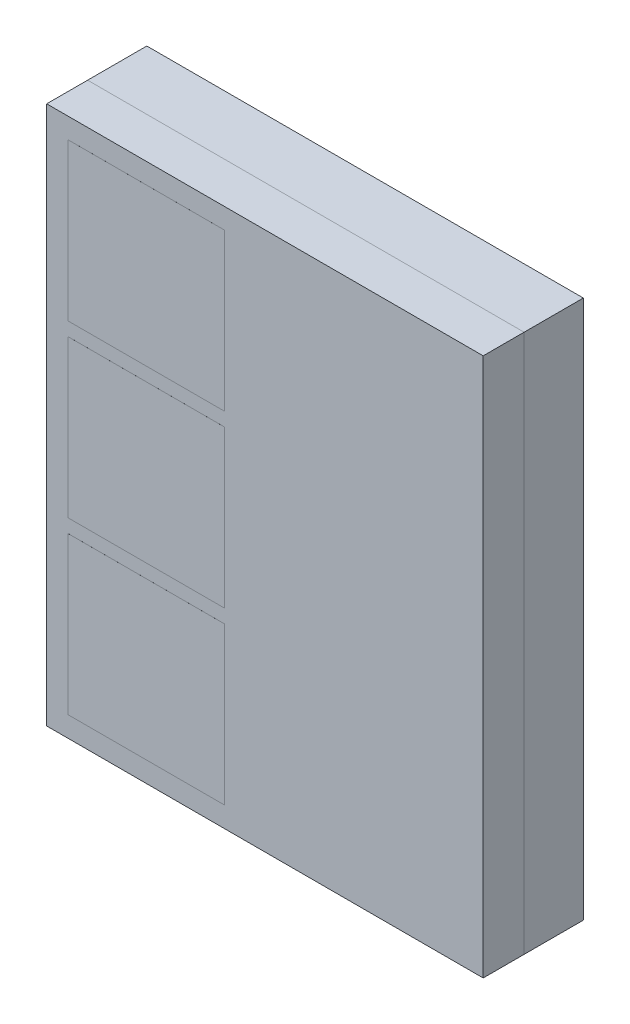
ISO-10303-21;
HEADER;
FILE_DESCRIPTION(('STEP AP214'),'2;1');
FILE_NAME('part.step','',(''),(''),'','','');
FILE_SCHEMA(('AUTOMOTIVE_DESIGN { 1 0 10303 214 1 1 1 1 }'));
ENDSEC;
DATA;
#1=APPLICATION_CONTEXT('core data for automotive mechanical design processes');
#2=APPLICATION_PROTOCOL_DEFINITION('international standard','automotive_design',2000,#1);
#3=PRODUCT_CONTEXT('',#1,'mechanical');
#4=PRODUCT('Part','Part','',(#3));
#5=PRODUCT_RELATED_PRODUCT_CATEGORY('part','',(#4));
#6=PRODUCT_DEFINITION_FORMATION('','',#4);
#7=PRODUCT_DEFINITION_CONTEXT('part definition',#1,'design');
#8=PRODUCT_DEFINITION('design','',#6,#7);
#9=PRODUCT_DEFINITION_SHAPE('','',#8);
#10=(LENGTH_UNIT() NAMED_UNIT(*) SI_UNIT(.MILLI.,.METRE.));
#11=(NAMED_UNIT(*) PLANE_ANGLE_UNIT() SI_UNIT($,.RADIAN.));
#12=(NAMED_UNIT(*) SI_UNIT($,.STERADIAN.) SOLID_ANGLE_UNIT());
#13=UNCERTAINTY_MEASURE_WITH_UNIT(LENGTH_MEASURE(1.E-05),#10,'distance_accuracy_value','');
#14=(GEOMETRIC_REPRESENTATION_CONTEXT(3) GLOBAL_UNCERTAINTY_ASSIGNED_CONTEXT((#13)) GLOBAL_UNIT_ASSIGNED_CONTEXT((#10,
#11,#12)) REPRESENTATION_CONTEXT('',''));
#15=CARTESIAN_POINT('',(0.,0.,0.));
#16=DIRECTION('',(0.,0.,1.));
#17=DIRECTION('',(1.,0.,0.));
#18=AXIS2_PLACEMENT_3D('',#15,#16,#17);
#19=CARTESIAN_POINT('',(0.42379144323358,1.345,-0.79));
#20=DIRECTION('',(0.,0.,1.));
#21=DIRECTION('',(1.,0.,0.));
#22=AXIS2_PLACEMENT_3D('',#19,#20,#21);
#23=CYLINDRICAL_SURFACE('',#22,0.3);
#24=CARTESIAN_POINT('',(0.42379144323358,1.345,-0.734));
#25=DIRECTION('',(0.,0.,-1.));
#26=DIRECTION('',(-1.,0.,0.));
#27=AXIS2_PLACEMENT_3D('',#24,#25,#26);
#28=CIRCLE('',#27,0.3);
#29=CARTESIAN_POINT('',(0.42379144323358,1.645,-0.734));
#30=VERTEX_POINT('',#29);
#31=CARTESIAN_POINT('',(0.72379144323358,1.345,-0.734));
#32=VERTEX_POINT('',#31);
#33=EDGE_CURVE('E146',#30,#32,#28,.T.);
#34=ORIENTED_EDGE('',*,*,#33,.T.);
#35=DIRECTION('',(0.,0.,1.));
#36=VECTOR('',#35,1.);
#37=CARTESIAN_POINT('',(0.72379144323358,1.345,-0.79));
#38=LINE('',#37,#36);
#39=CARTESIAN_POINT('',(0.72379144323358,1.345,-0.79));
#40=VERTEX_POINT('',#39);
#41=EDGE_CURVE('E12',#40,#32,#38,.T.);
#42=ORIENTED_EDGE('',*,*,#41,.F.);
#43=CARTESIAN_POINT('',(0.42379144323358,1.345,-0.79));
#44=DIRECTION('',(0.,0.,-1.));
#45=DIRECTION('',(-1.,0.,0.));
#46=AXIS2_PLACEMENT_3D('',#43,#44,#45);
#47=CIRCLE('',#46,0.3);
#48=CARTESIAN_POINT('',(0.42379144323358,1.645,-0.79));
#49=VERTEX_POINT('',#48);
#50=EDGE_CURVE('E160',#49,#40,#47,.T.);
#51=ORIENTED_EDGE('',*,*,#50,.F.);
#52=DIRECTION('',(0.,0.,1.));
#53=VECTOR('',#52,1.);
#54=CARTESIAN_POINT('',(0.42379144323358,1.645,-0.79));
#55=LINE('',#54,#53);
#56=EDGE_CURVE('E142',#49,#30,#55,.T.);
#57=ORIENTED_EDGE('',*,*,#56,.T.);
#58=EDGE_LOOP('',(#34,#42,#51,#57));
#59=FACE_BOUND('',#58,.T.);
#60=ADVANCED_FACE('F50',(#59),#23,.T.);
#61=CARTESIAN_POINT('',(0.72379144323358,0.445000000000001,-0.79));
#62=DIRECTION('',(-1.,0.,0.));
#63=DIRECTION('',(0.,0.,1.));
#64=AXIS2_PLACEMENT_3D('',#61,#62,#63);
#65=PLANE('',#64);
#66=DIRECTION('',(0.,-1.,0.));
#67=VECTOR('',#66,1.);
#68=CARTESIAN_POINT('',(0.72379144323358,0.445000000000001,-0.734));
#69=LINE('',#68,#67);
#70=CARTESIAN_POINT('',(0.72379144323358,0.445000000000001,-0.734));
#71=VERTEX_POINT('',#70);
#72=EDGE_CURVE('E149',#32,#71,#69,.T.);
#73=ORIENTED_EDGE('',*,*,#72,.T.);
#74=DIRECTION('',(0.,0.,1.));
#75=VECTOR('',#74,1.);
#76=CARTESIAN_POINT('',(0.72379144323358,0.445000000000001,-0.79));
#77=LINE('',#76,#75);
#78=CARTESIAN_POINT('',(0.72379144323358,0.445000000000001,-0.79));
#79=VERTEX_POINT('',#78);
#80=EDGE_CURVE('E58',#79,#71,#77,.T.);
#81=ORIENTED_EDGE('',*,*,#80,.F.);
#82=DIRECTION('',(0.,-1.,0.));
#83=VECTOR('',#82,1.);
#84=CARTESIAN_POINT('',(0.72379144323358,0.445000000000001,-0.79));
#85=LINE('',#84,#83);
#86=EDGE_CURVE('E109',#40,#79,#85,.T.);
#87=ORIENTED_EDGE('',*,*,#86,.F.);
#88=ORIENTED_EDGE('',*,*,#41,.T.);
#89=EDGE_LOOP('',(#73,#81,#87,#88));
#90=FACE_BOUND('',#89,.T.);
#91=ADVANCED_FACE('F195',(#90),#65,.F.);
#92=CARTESIAN_POINT('',(0.42379144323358,0.445000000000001,-0.79));
#93=DIRECTION('',(0.,0.,1.));
#94=DIRECTION('',(1.,0.,0.));
#95=AXIS2_PLACEMENT_3D('',#92,#93,#94);
#96=CYLINDRICAL_SURFACE('',#95,0.3);
#97=CARTESIAN_POINT('',(0.42379144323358,0.445000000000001,-0.734));
#98=DIRECTION('',(0.,0.,-1.));
#99=DIRECTION('',(-1.,0.,0.));
#100=AXIS2_PLACEMENT_3D('',#97,#98,#99);
#101=CIRCLE('',#100,0.3);
#102=CARTESIAN_POINT('',(0.42379144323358,0.145000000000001,-0.734));
#103=VERTEX_POINT('',#102);
#104=EDGE_CURVE('E151',#71,#103,#101,.T.);
#105=ORIENTED_EDGE('',*,*,#104,.T.);
#106=DIRECTION('',(0.,0.,1.));
#107=VECTOR('',#106,1.);
#108=CARTESIAN_POINT('',(0.42379144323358,0.145000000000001,-0.79));
#109=LINE('',#108,#107);
#110=CARTESIAN_POINT('',(0.42379144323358,0.145000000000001,-0.79));
#111=VERTEX_POINT('',#110);
#112=EDGE_CURVE('E167',#111,#103,#109,.T.);
#113=ORIENTED_EDGE('',*,*,#112,.F.);
#114=CARTESIAN_POINT('',(0.42379144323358,0.445000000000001,-0.79));
#115=DIRECTION('',(0.,0.,-1.));
#116=DIRECTION('',(-1.,0.,0.));
#117=AXIS2_PLACEMENT_3D('',#114,#115,#116);
#118=CIRCLE('',#117,0.3);
#119=EDGE_CURVE('E175',#79,#111,#118,.T.);
#120=ORIENTED_EDGE('',*,*,#119,.F.);
#121=ORIENTED_EDGE('',*,*,#80,.T.);
#122=EDGE_LOOP('',(#105,#113,#120,#121));
#123=FACE_BOUND('',#122,.T.);
#124=ADVANCED_FACE('F173',(#123),#96,.T.);
#125=CARTESIAN_POINT('',(-0.25,0.145000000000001,-0.79));
#126=DIRECTION('',(0.,1.,0.));
#127=DIRECTION('',(-1.,0.,0.));
#128=AXIS2_PLACEMENT_3D('',#125,#126,#127);
#129=PLANE('',#128);
#130=DIRECTION('',(-1.,0.,0.));
#131=VECTOR('',#130,1.);
#132=CARTESIAN_POINT('',(-0.25,0.145000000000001,-0.734));
#133=LINE('',#132,#131);
#134=CARTESIAN_POINT('',(-0.25,0.145000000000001,-0.734));
#135=VERTEX_POINT('',#134);
#136=EDGE_CURVE('E153',#103,#135,#133,.T.);
#137=ORIENTED_EDGE('',*,*,#136,.T.);
#138=DIRECTION('',(0.,0.,1.));
#139=VECTOR('',#138,1.);
#140=CARTESIAN_POINT('',(-0.25,0.145000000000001,-0.79));
#141=LINE('',#140,#139);
#142=CARTESIAN_POINT('',(-0.25,0.145000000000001,-0.79));
#143=VERTEX_POINT('',#142);
#144=EDGE_CURVE('E164',#143,#135,#141,.T.);
#145=ORIENTED_EDGE('',*,*,#144,.F.);
#146=DIRECTION('',(-1.,0.,0.));
#147=VECTOR('',#146,1.);
#148=CARTESIAN_POINT('',(-0.25,0.145000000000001,-0.79));
#149=LINE('',#148,#147);
#150=EDGE_CURVE('E187',#111,#143,#149,.T.);
#151=ORIENTED_EDGE('',*,*,#150,.F.);
#152=ORIENTED_EDGE('',*,*,#112,.T.);
#153=EDGE_LOOP('',(#137,#145,#151,#152));
#154=FACE_BOUND('',#153,.T.);
#155=ADVANCED_FACE('F183',(#154),#129,.F.);
#156=CARTESIAN_POINT('',(-0.25,0.445000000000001,-0.79));
#157=DIRECTION('',(0.,0.,1.));
#158=DIRECTION('',(1.,0.,0.));
#159=AXIS2_PLACEMENT_3D('',#156,#157,#158);
#160=CYLINDRICAL_SURFACE('',#159,0.3);
#161=CARTESIAN_POINT('',(-0.25,0.445000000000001,-0.734));
#162=DIRECTION('',(0.,0.,-1.));
#163=DIRECTION('',(-1.,0.,0.));
#164=AXIS2_PLACEMENT_3D('',#161,#162,#163);
#165=CIRCLE('',#164,0.3);
#166=CARTESIAN_POINT('',(-0.55,0.445000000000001,-0.734));
#167=VERTEX_POINT('',#166);
#168=EDGE_CURVE('E155',#135,#167,#165,.T.);
#169=ORIENTED_EDGE('',*,*,#168,.T.);
#170=DIRECTION('',(0.,0.,1.));
#171=VECTOR('',#170,1.);
#172=CARTESIAN_POINT('',(-0.55,0.445000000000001,-0.79));
#173=LINE('',#172,#171);
#174=CARTESIAN_POINT('',(-0.55,0.445000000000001,-0.79));
#175=VERTEX_POINT('',#174);
#176=EDGE_CURVE('E137',#175,#167,#173,.T.);
#177=ORIENTED_EDGE('',*,*,#176,.F.);
#178=CARTESIAN_POINT('',(-0.25,0.445000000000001,-0.79));
#179=DIRECTION('',(0.,0.,-1.));
#180=DIRECTION('',(-1.,0.,0.));
#181=AXIS2_PLACEMENT_3D('',#178,#179,#180);
#182=CIRCLE('',#181,0.3);
#183=EDGE_CURVE('E128',#143,#175,#182,.T.);
#184=ORIENTED_EDGE('',*,*,#183,.F.);
#185=ORIENTED_EDGE('',*,*,#144,.T.);
#186=EDGE_LOOP('',(#169,#177,#184,#185));
#187=FACE_BOUND('',#186,.T.);
#188=ADVANCED_FACE('F186',(#187),#160,.T.);
#189=CARTESIAN_POINT('',(-0.55,0.445000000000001,-0.79));
#190=DIRECTION('',(1.,0.,0.));
#191=DIRECTION('',(0.,1.,0.));
#192=AXIS2_PLACEMENT_3D('',#189,#190,#191);
#193=PLANE('',#192);
#194=DIRECTION('',(0.,1.,0.));
#195=VECTOR('',#194,1.);
#196=CARTESIAN_POINT('',(-0.55,0.445000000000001,-0.734));
#197=LINE('',#196,#195);
#198=CARTESIAN_POINT('',(-0.55,1.345,-0.734));
#199=VERTEX_POINT('',#198);
#200=EDGE_CURVE('E136',#167,#199,#197,.T.);
#201=ORIENTED_EDGE('',*,*,#200,.T.);
#202=DIRECTION('',(0.,0.,1.));
#203=VECTOR('',#202,1.);
#204=CARTESIAN_POINT('',(-0.55,1.345,-0.79));
#205=LINE('',#204,#203);
#206=CARTESIAN_POINT('',(-0.55,1.345,-0.79));
#207=VERTEX_POINT('',#206);
#208=EDGE_CURVE('E133',#207,#199,#205,.T.);
#209=ORIENTED_EDGE('',*,*,#208,.F.);
#210=DIRECTION('',(0.,1.,0.));
#211=VECTOR('',#210,1.);
#212=CARTESIAN_POINT('',(-0.55,0.445000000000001,-0.79));
#213=LINE('',#212,#211);
#214=EDGE_CURVE('E122',#175,#207,#213,.T.);
#215=ORIENTED_EDGE('',*,*,#214,.F.);
#216=ORIENTED_EDGE('',*,*,#176,.T.);
#217=EDGE_LOOP('',(#201,#209,#215,#216));
#218=FACE_BOUND('',#217,.T.);
#219=ADVANCED_FACE('F134',(#218),#193,.F.);
#220=CARTESIAN_POINT('',(-0.25,1.345,-0.79));
#221=DIRECTION('',(0.,0.,1.));
#222=DIRECTION('',(1.,0.,0.));
#223=AXIS2_PLACEMENT_3D('',#220,#221,#222);
#224=CYLINDRICAL_SURFACE('',#223,0.3);
#225=CARTESIAN_POINT('',(-0.25,1.345,-0.734));
#226=DIRECTION('',(0.,0.,-1.));
#227=DIRECTION('',(-1.,0.,0.));
#228=AXIS2_PLACEMENT_3D('',#225,#226,#227);
#229=CIRCLE('',#228,0.3);
#230=CARTESIAN_POINT('',(-0.25,1.645,-0.734));
#231=VERTEX_POINT('',#230);
#232=EDGE_CURVE('E95',#199,#231,#229,.T.);
#233=ORIENTED_EDGE('',*,*,#232,.T.);
#234=DIRECTION('',(0.,0.,1.));
#235=VECTOR('',#234,1.);
#236=CARTESIAN_POINT('',(-0.25,1.645,-0.79));
#237=LINE('',#236,#235);
#238=CARTESIAN_POINT('',(-0.25,1.645,-0.79));
#239=VERTEX_POINT('',#238);
#240=EDGE_CURVE('E138',#239,#231,#237,.T.);
#241=ORIENTED_EDGE('',*,*,#240,.F.);
#242=CARTESIAN_POINT('',(-0.25,1.345,-0.79));
#243=DIRECTION('',(0.,0.,-1.));
#244=DIRECTION('',(-1.,0.,0.));
#245=AXIS2_PLACEMENT_3D('',#242,#243,#244);
#246=CIRCLE('',#245,0.3);
#247=EDGE_CURVE('E126',#207,#239,#246,.T.);
#248=ORIENTED_EDGE('',*,*,#247,.F.);
#249=ORIENTED_EDGE('',*,*,#208,.T.);
#250=EDGE_LOOP('',(#233,#241,#248,#249));
#251=FACE_BOUND('',#250,.T.);
#252=ADVANCED_FACE('F140',(#251),#224,.T.);
#253=CARTESIAN_POINT('',(-0.25,1.645,-0.79));
#254=DIRECTION('',(0.,-1.,0.));
#255=DIRECTION('',(0.,0.,-1.));
#256=AXIS2_PLACEMENT_3D('',#253,#254,#255);
#257=PLANE('',#256);
#258=DIRECTION('',(1.,0.,0.));
#259=VECTOR('',#258,1.);
#260=CARTESIAN_POINT('',(-0.25,1.645,-0.734));
#261=LINE('',#260,#259);
#262=EDGE_CURVE('E101',#231,#30,#261,.T.);
#263=ORIENTED_EDGE('',*,*,#262,.T.);
#264=ORIENTED_EDGE('',*,*,#56,.F.);
#265=DIRECTION('',(1.,0.,0.));
#266=VECTOR('',#265,1.);
#267=CARTESIAN_POINT('',(-0.25,1.645,-0.79));
#268=LINE('',#267,#266);
#269=EDGE_CURVE('E66',#239,#49,#268,.T.);
#270=ORIENTED_EDGE('',*,*,#269,.F.);
#271=ORIENTED_EDGE('',*,*,#240,.T.);
#272=EDGE_LOOP('',(#263,#264,#270,#271));
#273=FACE_BOUND('',#272,.T.);
#274=ADVANCED_FACE('F211',(#273),#257,.F.);
#275=CARTESIAN_POINT('',(0.42379144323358,1.345,-0.79));
#276=DIRECTION('',(0.,0.,-1.));
#277=DIRECTION('',(-1.,0.,0.));
#278=AXIS2_PLACEMENT_3D('',#275,#276,#277);
#279=PLANE('',#278);
#280=ORIENTED_EDGE('',*,*,#50,.T.);
#281=ORIENTED_EDGE('',*,*,#86,.T.);
#282=ORIENTED_EDGE('',*,*,#119,.T.);
#283=ORIENTED_EDGE('',*,*,#150,.T.);
#284=ORIENTED_EDGE('',*,*,#183,.T.);
#285=ORIENTED_EDGE('',*,*,#214,.T.);
#286=ORIENTED_EDGE('',*,*,#247,.T.);
#287=ORIENTED_EDGE('',*,*,#269,.T.);
#288=EDGE_LOOP('',(#280,#281,#282,#283,#284,#285,#286,#287));
#289=FACE_BOUND('',#288,.T.);
#290=ADVANCED_FACE('F124',(#289),#279,.T.);
#291=CARTESIAN_POINT('',(0.42379144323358,1.345,-0.734));
#292=DIRECTION('',(0.,0.,-1.));
#293=DIRECTION('',(-1.,0.,0.));
#294=AXIS2_PLACEMENT_3D('',#291,#292,#293);
#295=PLANE('',#294);
#296=ORIENTED_EDGE('',*,*,#33,.F.);
#297=ORIENTED_EDGE('',*,*,#262,.F.);
#298=ORIENTED_EDGE('',*,*,#232,.F.);
#299=ORIENTED_EDGE('',*,*,#200,.F.);
#300=ORIENTED_EDGE('',*,*,#168,.F.);
#301=ORIENTED_EDGE('',*,*,#136,.F.);
#302=ORIENTED_EDGE('',*,*,#104,.F.);
#303=ORIENTED_EDGE('',*,*,#72,.F.);
#304=EDGE_LOOP('',(#296,#297,#298,#299,#300,#301,#302,#303));
#305=FACE_BOUND('',#304,.T.);
#306=ADVANCED_FACE('F179',(#305),#295,.F.);
#307=CLOSED_SHELL('',(#60,#91,#124,#155,#188,#219,#252,#274,#290,#306));
#308=MANIFOLD_SOLID_BREP('B2',#307);
#309=CARTESIAN_POINT('',(0.42,-0.445000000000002,-0.79));
#310=DIRECTION('',(0.,0.,1.));
#311=DIRECTION('',(1.,0.,0.));
#312=AXIS2_PLACEMENT_3D('',#309,#310,#311);
#313=CYLINDRICAL_SURFACE('',#312,0.3);
#314=CARTESIAN_POINT('',(0.42,-0.445000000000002,-0.734));
#315=DIRECTION('',(0.,0.,-1.));
#316=DIRECTION('',(-1.,0.,0.));
#317=AXIS2_PLACEMENT_3D('',#314,#315,#316);
#318=CIRCLE('',#317,0.3);
#319=CARTESIAN_POINT('',(0.42,-0.145000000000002,-0.734));
#320=VERTEX_POINT('',#319);
#321=CARTESIAN_POINT('',(0.72,-0.445000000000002,-0.734));
#322=VERTEX_POINT('',#321);
#323=EDGE_CURVE('E384',#320,#322,#318,.T.);
#324=ORIENTED_EDGE('',*,*,#323,.T.);
#325=DIRECTION('',(0.,0.,1.));
#326=VECTOR('',#325,1.);
#327=CARTESIAN_POINT('',(0.72,-0.445000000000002,-0.79));
#328=LINE('',#327,#326);
#329=CARTESIAN_POINT('',(0.72,-0.445000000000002,-0.79));
#330=VERTEX_POINT('',#329);
#331=EDGE_CURVE('E48',#330,#322,#328,.T.);
#332=ORIENTED_EDGE('',*,*,#331,.F.);
#333=CARTESIAN_POINT('',(0.42,-0.445000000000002,-0.79));
#334=DIRECTION('',(0.,0.,-1.));
#335=DIRECTION('',(-1.,0.,0.));
#336=AXIS2_PLACEMENT_3D('',#333,#334,#335);
#337=CIRCLE('',#336,0.3);
#338=CARTESIAN_POINT('',(0.42,-0.145000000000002,-0.79));
#339=VERTEX_POINT('',#338);
#340=EDGE_CURVE('E398',#339,#330,#337,.T.);
#341=ORIENTED_EDGE('',*,*,#340,.F.);
#342=DIRECTION('',(0.,0.,1.));
#343=VECTOR('',#342,1.);
#344=CARTESIAN_POINT('',(0.42,-0.145000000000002,-0.79));
#345=LINE('',#344,#343);
#346=EDGE_CURVE('E380',#339,#320,#345,.T.);
#347=ORIENTED_EDGE('',*,*,#346,.T.);
#348=EDGE_LOOP('',(#324,#332,#341,#347));
#349=FACE_BOUND('',#348,.T.);
#350=ADVANCED_FACE('F288',(#349),#313,.T.);
#351=CARTESIAN_POINT('',(0.72,-1.345,-0.79));
#352=DIRECTION('',(-1.,0.,0.));
#353=DIRECTION('',(0.,0.,1.));
#354=AXIS2_PLACEMENT_3D('',#351,#352,#353);
#355=PLANE('',#354);
#356=DIRECTION('',(0.,-1.,0.));
#357=VECTOR('',#356,1.);
#358=CARTESIAN_POINT('',(0.72,-1.345,-0.734));
#359=LINE('',#358,#357);
#360=CARTESIAN_POINT('',(0.72,-1.345,-0.734));
#361=VERTEX_POINT('',#360);
#362=EDGE_CURVE('E387',#322,#361,#359,.T.);
#363=ORIENTED_EDGE('',*,*,#362,.T.);
#364=DIRECTION('',(0.,0.,1.));
#365=VECTOR('',#364,1.);
#366=CARTESIAN_POINT('',(0.72,-1.345,-0.79));
#367=LINE('',#366,#365);
#368=CARTESIAN_POINT('',(0.72,-1.345,-0.79));
#369=VERTEX_POINT('',#368);
#370=EDGE_CURVE('E296',#369,#361,#367,.T.);
#371=ORIENTED_EDGE('',*,*,#370,.F.);
#372=DIRECTION('',(0.,-1.,0.));
#373=VECTOR('',#372,1.);
#374=CARTESIAN_POINT('',(0.72,-1.345,-0.79));
#375=LINE('',#374,#373);
#376=EDGE_CURVE('E347',#330,#369,#375,.T.);
#377=ORIENTED_EDGE('',*,*,#376,.F.);
#378=ORIENTED_EDGE('',*,*,#331,.T.);
#379=EDGE_LOOP('',(#363,#371,#377,#378));
#380=FACE_BOUND('',#379,.T.);
#381=ADVANCED_FACE('F433',(#380),#355,.F.);
#382=CARTESIAN_POINT('',(0.42,-1.345,-0.79));
#383=DIRECTION('',(0.,0.,1.));
#384=DIRECTION('',(1.,0.,0.));
#385=AXIS2_PLACEMENT_3D('',#382,#383,#384);
#386=CYLINDRICAL_SURFACE('',#385,0.3);
#387=CARTESIAN_POINT('',(0.42,-1.345,-0.734));
#388=DIRECTION('',(0.,0.,-1.));
#389=DIRECTION('',(-1.,0.,0.));
#390=AXIS2_PLACEMENT_3D('',#387,#388,#389);
#391=CIRCLE('',#390,0.3);
#392=CARTESIAN_POINT('',(0.42,-1.645,-0.734));
#393=VERTEX_POINT('',#392);
#394=EDGE_CURVE('E389',#361,#393,#391,.T.);
#395=ORIENTED_EDGE('',*,*,#394,.T.);
#396=DIRECTION('',(0.,0.,1.));
#397=VECTOR('',#396,1.);
#398=CARTESIAN_POINT('',(0.42,-1.645,-0.79));
#399=LINE('',#398,#397);
#400=CARTESIAN_POINT('',(0.42,-1.645,-0.79));
#401=VERTEX_POINT('',#400);
#402=EDGE_CURVE('E405',#401,#393,#399,.T.);
#403=ORIENTED_EDGE('',*,*,#402,.F.);
#404=CARTESIAN_POINT('',(0.42,-1.345,-0.79));
#405=DIRECTION('',(0.,0.,-1.));
#406=DIRECTION('',(-1.,0.,0.));
#407=AXIS2_PLACEMENT_3D('',#404,#405,#406);
#408=CIRCLE('',#407,0.3);
#409=EDGE_CURVE('E413',#369,#401,#408,.T.);
#410=ORIENTED_EDGE('',*,*,#409,.F.);
#411=ORIENTED_EDGE('',*,*,#370,.T.);
#412=EDGE_LOOP('',(#395,#403,#410,#411));
#413=FACE_BOUND('',#412,.T.);
#414=ADVANCED_FACE('F411',(#413),#386,.T.);
#415=CARTESIAN_POINT('',(-0.25,-1.645,-0.79));
#416=DIRECTION('',(0.,1.,0.));
#417=DIRECTION('',(-1.,0.,0.));
#418=AXIS2_PLACEMENT_3D('',#415,#416,#417);
#419=PLANE('',#418);
#420=DIRECTION('',(-1.,0.,0.));
#421=VECTOR('',#420,1.);
#422=CARTESIAN_POINT('',(-0.25,-1.645,-0.734));
#423=LINE('',#422,#421);
#424=CARTESIAN_POINT('',(-0.25,-1.645,-0.734));
#425=VERTEX_POINT('',#424);
#426=EDGE_CURVE('E391',#393,#425,#423,.T.);
#427=ORIENTED_EDGE('',*,*,#426,.T.);
#428=DIRECTION('',(0.,0.,1.));
#429=VECTOR('',#428,1.);
#430=CARTESIAN_POINT('',(-0.25,-1.645,-0.79));
#431=LINE('',#430,#429);
#432=CARTESIAN_POINT('',(-0.25,-1.645,-0.79));
#433=VERTEX_POINT('',#432);
#434=EDGE_CURVE('E402',#433,#425,#431,.T.);
#435=ORIENTED_EDGE('',*,*,#434,.F.);
#436=DIRECTION('',(-1.,0.,0.));
#437=VECTOR('',#436,1.);
#438=CARTESIAN_POINT('',(-0.25,-1.645,-0.79));
#439=LINE('',#438,#437);
#440=EDGE_CURVE('E425',#401,#433,#439,.T.);
#441=ORIENTED_EDGE('',*,*,#440,.F.);
#442=ORIENTED_EDGE('',*,*,#402,.T.);
#443=EDGE_LOOP('',(#427,#435,#441,#442));
#444=FACE_BOUND('',#443,.T.);
#445=ADVANCED_FACE('F421',(#444),#419,.F.);
#446=CARTESIAN_POINT('',(-0.25,-1.345,-0.79));
#447=DIRECTION('',(0.,0.,1.));
#448=DIRECTION('',(1.,0.,0.));
#449=AXIS2_PLACEMENT_3D('',#446,#447,#448);
#450=CYLINDRICAL_SURFACE('',#449,0.3);
#451=CARTESIAN_POINT('',(-0.25,-1.345,-0.734));
#452=DIRECTION('',(0.,0.,-1.));
#453=DIRECTION('',(-1.,0.,0.));
#454=AXIS2_PLACEMENT_3D('',#451,#452,#453);
#455=CIRCLE('',#454,0.3);
#456=CARTESIAN_POINT('',(-0.55,-1.345,-0.734));
#457=VERTEX_POINT('',#456);
#458=EDGE_CURVE('E393',#425,#457,#455,.T.);
#459=ORIENTED_EDGE('',*,*,#458,.T.);
#460=DIRECTION('',(0.,0.,1.));
#461=VECTOR('',#460,1.);
#462=CARTESIAN_POINT('',(-0.55,-1.345,-0.79));
#463=LINE('',#462,#461);
#464=CARTESIAN_POINT('',(-0.55,-1.345,-0.79));
#465=VERTEX_POINT('',#464);
#466=EDGE_CURVE('E375',#465,#457,#463,.T.);
#467=ORIENTED_EDGE('',*,*,#466,.F.);
#468=CARTESIAN_POINT('',(-0.25,-1.345,-0.79));
#469=DIRECTION('',(0.,0.,-1.));
#470=DIRECTION('',(-1.,0.,0.));
#471=AXIS2_PLACEMENT_3D('',#468,#469,#470);
#472=CIRCLE('',#471,0.3);
#473=EDGE_CURVE('E366',#433,#465,#472,.T.);
#474=ORIENTED_EDGE('',*,*,#473,.F.);
#475=ORIENTED_EDGE('',*,*,#434,.T.);
#476=EDGE_LOOP('',(#459,#467,#474,#475));
#477=FACE_BOUND('',#476,.T.);
#478=ADVANCED_FACE('F424',(#477),#450,.T.);
#479=CARTESIAN_POINT('',(-0.55,-1.345,-0.79));
#480=DIRECTION('',(1.,0.,0.));
#481=DIRECTION('',(0.,1.,0.));
#482=AXIS2_PLACEMENT_3D('',#479,#480,#481);
#483=PLANE('',#482);
#484=DIRECTION('',(0.,1.,0.));
#485=VECTOR('',#484,1.);
#486=CARTESIAN_POINT('',(-0.55,-1.345,-0.734));
#487=LINE('',#486,#485);
#488=CARTESIAN_POINT('',(-0.55,-0.445000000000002,-0.734));
#489=VERTEX_POINT('',#488);
#490=EDGE_CURVE('E374',#457,#489,#487,.T.);
#491=ORIENTED_EDGE('',*,*,#490,.T.);
#492=DIRECTION('',(0.,0.,1.));
#493=VECTOR('',#492,1.);
#494=CARTESIAN_POINT('',(-0.55,-0.445000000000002,-0.79));
#495=LINE('',#494,#493);
#496=CARTESIAN_POINT('',(-0.55,-0.445000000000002,-0.79));
#497=VERTEX_POINT('',#496);
#498=EDGE_CURVE('E371',#497,#489,#495,.T.);
#499=ORIENTED_EDGE('',*,*,#498,.F.);
#500=DIRECTION('',(0.,1.,0.));
#501=VECTOR('',#500,1.);
#502=CARTESIAN_POINT('',(-0.55,-1.345,-0.79));
#503=LINE('',#502,#501);
#504=EDGE_CURVE('E360',#465,#497,#503,.T.);
#505=ORIENTED_EDGE('',*,*,#504,.F.);
#506=ORIENTED_EDGE('',*,*,#466,.T.);
#507=EDGE_LOOP('',(#491,#499,#505,#506));
#508=FACE_BOUND('',#507,.T.);
#509=ADVANCED_FACE('F372',(#508),#483,.F.);
#510=CARTESIAN_POINT('',(-0.25,-0.445000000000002,-0.79));
#511=DIRECTION('',(0.,0.,1.));
#512=DIRECTION('',(1.,0.,0.));
#513=AXIS2_PLACEMENT_3D('',#510,#511,#512);
#514=CYLINDRICAL_SURFACE('',#513,0.3);
#515=CARTESIAN_POINT('',(-0.25,-0.445000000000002,-0.734));
#516=DIRECTION('',(0.,0.,-1.));
#517=DIRECTION('',(-1.,0.,0.));
#518=AXIS2_PLACEMENT_3D('',#515,#516,#517);
#519=CIRCLE('',#518,0.3);
#520=CARTESIAN_POINT('',(-0.25,-0.145000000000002,-0.734));
#521=VERTEX_POINT('',#520);
#522=EDGE_CURVE('E333',#489,#521,#519,.T.);
#523=ORIENTED_EDGE('',*,*,#522,.T.);
#524=DIRECTION('',(0.,0.,1.));
#525=VECTOR('',#524,1.);
#526=CARTESIAN_POINT('',(-0.25,-0.145000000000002,-0.79));
#527=LINE('',#526,#525);
#528=CARTESIAN_POINT('',(-0.25,-0.145000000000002,-0.79));
#529=VERTEX_POINT('',#528);
#530=EDGE_CURVE('E376',#529,#521,#527,.T.);
#531=ORIENTED_EDGE('',*,*,#530,.F.);
#532=CARTESIAN_POINT('',(-0.25,-0.445000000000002,-0.79));
#533=DIRECTION('',(0.,0.,-1.));
#534=DIRECTION('',(-1.,0.,0.));
#535=AXIS2_PLACEMENT_3D('',#532,#533,#534);
#536=CIRCLE('',#535,0.3);
#537=EDGE_CURVE('E364',#497,#529,#536,.T.);
#538=ORIENTED_EDGE('',*,*,#537,.F.);
#539=ORIENTED_EDGE('',*,*,#498,.T.);
#540=EDGE_LOOP('',(#523,#531,#538,#539));
#541=FACE_BOUND('',#540,.T.);
#542=ADVANCED_FACE('F378',(#541),#514,.T.);
#543=CARTESIAN_POINT('',(-0.25,-0.145000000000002,-0.79));
#544=DIRECTION('',(0.,-1.,0.));
#545=DIRECTION('',(1.,0.,0.));
#546=AXIS2_PLACEMENT_3D('',#543,#544,#545);
#547=PLANE('',#546);
#548=DIRECTION('',(1.,0.,0.));
#549=VECTOR('',#548,1.);
#550=CARTESIAN_POINT('',(-0.25,-0.145000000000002,-0.734));
#551=LINE('',#550,#549);
#552=EDGE_CURVE('E339',#521,#320,#551,.T.);
#553=ORIENTED_EDGE('',*,*,#552,.T.);
#554=ORIENTED_EDGE('',*,*,#346,.F.);
#555=DIRECTION('',(1.,0.,0.));
#556=VECTOR('',#555,1.);
#557=CARTESIAN_POINT('',(-0.25,-0.145000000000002,-0.79));
#558=LINE('',#557,#556);
#559=EDGE_CURVE('E304',#529,#339,#558,.T.);
#560=ORIENTED_EDGE('',*,*,#559,.F.);
#561=ORIENTED_EDGE('',*,*,#530,.T.);
#562=EDGE_LOOP('',(#553,#554,#560,#561));
#563=FACE_BOUND('',#562,.T.);
#564=ADVANCED_FACE('F449',(#563),#547,.F.);
#565=CARTESIAN_POINT('',(0.42,-0.445000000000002,-0.79));
#566=DIRECTION('',(0.,0.,-1.));
#567=DIRECTION('',(-1.,0.,0.));
#568=AXIS2_PLACEMENT_3D('',#565,#566,#567);
#569=PLANE('',#568);
#570=ORIENTED_EDGE('',*,*,#340,.T.);
#571=ORIENTED_EDGE('',*,*,#376,.T.);
#572=ORIENTED_EDGE('',*,*,#409,.T.);
#573=ORIENTED_EDGE('',*,*,#440,.T.);
#574=ORIENTED_EDGE('',*,*,#473,.T.);
#575=ORIENTED_EDGE('',*,*,#504,.T.);
#576=ORIENTED_EDGE('',*,*,#537,.T.);
#577=ORIENTED_EDGE('',*,*,#559,.T.);
#578=EDGE_LOOP('',(#570,#571,#572,#573,#574,#575,#576,#577));
#579=FACE_BOUND('',#578,.T.);
#580=ADVANCED_FACE('F362',(#579),#569,.T.);
#581=CARTESIAN_POINT('',(0.42,-0.445000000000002,-0.734));
#582=DIRECTION('',(0.,0.,-1.));
#583=DIRECTION('',(-1.,0.,0.));
#584=AXIS2_PLACEMENT_3D('',#581,#582,#583);
#585=PLANE('',#584);
#586=ORIENTED_EDGE('',*,*,#323,.F.);
#587=ORIENTED_EDGE('',*,*,#552,.F.);
#588=ORIENTED_EDGE('',*,*,#522,.F.);
#589=ORIENTED_EDGE('',*,*,#490,.F.);
#590=ORIENTED_EDGE('',*,*,#458,.F.);
#591=ORIENTED_EDGE('',*,*,#426,.F.);
#592=ORIENTED_EDGE('',*,*,#394,.F.);
#593=ORIENTED_EDGE('',*,*,#362,.F.);
#594=EDGE_LOOP('',(#586,#587,#588,#589,#590,#591,#592,#593));
#595=FACE_BOUND('',#594,.T.);
#596=ADVANCED_FACE('F417',(#595),#585,.F.);
#597=CLOSED_SHELL('',(#350,#381,#414,#445,#478,#509,#542,#564,#580,#596));
#598=MANIFOLD_SOLID_BREP('B6',#597);
#599=CARTESIAN_POINT('',(1.99,-0.414909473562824,-0.79));
#600=DIRECTION('',(0.,0.,1.));
#601=DIRECTION('',(1.,0.,0.));
#602=AXIS2_PLACEMENT_3D('',#599,#600,#601);
#603=CYLINDRICAL_SURFACE('',#602,0.3);
#604=CARTESIAN_POINT('',(1.99,-0.414909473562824,-0.734));
#605=DIRECTION('',(0.,0.,-1.));
#606=DIRECTION('',(-1.,0.,0.));
#607=AXIS2_PLACEMENT_3D('',#604,#605,#606);
#608=CIRCLE('',#607,0.3);
#609=CARTESIAN_POINT('',(1.99,-0.114909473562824,-0.734));
#610=VERTEX_POINT('',#609);
#611=CARTESIAN_POINT('',(2.29,-0.414909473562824,-0.734));
#612=VERTEX_POINT('',#611);
#613=EDGE_CURVE('E622',#610,#612,#608,.T.);
#614=ORIENTED_EDGE('',*,*,#613,.T.);
#615=DIRECTION('',(0.,0.,1.));
#616=VECTOR('',#615,1.);
#617=CARTESIAN_POINT('',(2.29,-0.414909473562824,-0.79));
#618=LINE('',#617,#616);
#619=CARTESIAN_POINT('',(2.29,-0.414909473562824,-0.79));
#620=VERTEX_POINT('',#619);
#621=EDGE_CURVE('E286',#620,#612,#618,.T.);
#622=ORIENTED_EDGE('',*,*,#621,.F.);
#623=CARTESIAN_POINT('',(1.99,-0.414909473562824,-0.79));
#624=DIRECTION('',(0.,0.,-1.));
#625=DIRECTION('',(-1.,0.,0.));
#626=AXIS2_PLACEMENT_3D('',#623,#624,#625);
#627=CIRCLE('',#626,0.3);
#628=CARTESIAN_POINT('',(1.99,-0.114909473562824,-0.79));
#629=VERTEX_POINT('',#628);
#630=EDGE_CURVE('E636',#629,#620,#627,.T.);
#631=ORIENTED_EDGE('',*,*,#630,.F.);
#632=DIRECTION('',(0.,0.,1.));
#633=VECTOR('',#632,1.);
#634=CARTESIAN_POINT('',(1.99,-0.114909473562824,-0.79));
#635=LINE('',#634,#633);
#636=EDGE_CURVE('E618',#629,#610,#635,.T.);
#637=ORIENTED_EDGE('',*,*,#636,.T.);
#638=EDGE_LOOP('',(#614,#622,#631,#637));
#639=FACE_BOUND('',#638,.T.);
#640=ADVANCED_FACE('F526',(#639),#603,.T.);
#641=CARTESIAN_POINT('',(2.29,-1.345,-0.79));
#642=DIRECTION('',(-1.,0.,0.));
#643=DIRECTION('',(0.,0.,1.));
#644=AXIS2_PLACEMENT_3D('',#641,#642,#643);
#645=PLANE('',#644);
#646=DIRECTION('',(0.,-1.,0.));
#647=VECTOR('',#646,1.);
#648=CARTESIAN_POINT('',(2.29,-1.345,-0.734));
#649=LINE('',#648,#647);
#650=CARTESIAN_POINT('',(2.29,-1.345,-0.734));
#651=VERTEX_POINT('',#650);
#652=EDGE_CURVE('E625',#612,#651,#649,.T.);
#653=ORIENTED_EDGE('',*,*,#652,.T.);
#654=DIRECTION('',(0.,0.,1.));
#655=VECTOR('',#654,1.);
#656=CARTESIAN_POINT('',(2.29,-1.345,-0.79));
#657=LINE('',#656,#655);
#658=CARTESIAN_POINT('',(2.29,-1.345,-0.79));
#659=VERTEX_POINT('',#658);
#660=EDGE_CURVE('E534',#659,#651,#657,.T.);
#661=ORIENTED_EDGE('',*,*,#660,.F.);
#662=DIRECTION('',(0.,-1.,0.));
#663=VECTOR('',#662,1.);
#664=CARTESIAN_POINT('',(2.29,-1.345,-0.79));
#665=LINE('',#664,#663);
#666=EDGE_CURVE('E585',#620,#659,#665,.T.);
#667=ORIENTED_EDGE('',*,*,#666,.F.);
#668=ORIENTED_EDGE('',*,*,#621,.T.);
#669=EDGE_LOOP('',(#653,#661,#667,#668));
#670=FACE_BOUND('',#669,.T.);
#671=ADVANCED_FACE('F671',(#670),#645,.F.);
#672=CARTESIAN_POINT('',(1.99,-1.345,-0.79));
#673=DIRECTION('',(0.,0.,1.));
#674=DIRECTION('',(1.,0.,0.));
#675=AXIS2_PLACEMENT_3D('',#672,#673,#674);
#676=CYLINDRICAL_SURFACE('',#675,0.3);
#677=CARTESIAN_POINT('',(1.99,-1.345,-0.734));
#678=DIRECTION('',(0.,0.,-1.));
#679=DIRECTION('',(-1.,0.,0.));
#680=AXIS2_PLACEMENT_3D('',#677,#678,#679);
#681=CIRCLE('',#680,0.3);
#682=CARTESIAN_POINT('',(1.99,-1.645,-0.734));
#683=VERTEX_POINT('',#682);
#684=EDGE_CURVE('E627',#651,#683,#681,.T.);
#685=ORIENTED_EDGE('',*,*,#684,.T.);
#686=DIRECTION('',(0.,0.,1.));
#687=VECTOR('',#686,1.);
#688=CARTESIAN_POINT('',(1.99,-1.645,-0.79));
#689=LINE('',#688,#687);
#690=CARTESIAN_POINT('',(1.99,-1.645,-0.79));
#691=VERTEX_POINT('',#690);
#692=EDGE_CURVE('E643',#691,#683,#689,.T.);
#693=ORIENTED_EDGE('',*,*,#692,.F.);
#694=CARTESIAN_POINT('',(1.99,-1.345,-0.79));
#695=DIRECTION('',(0.,0.,-1.));
#696=DIRECTION('',(-1.,0.,0.));
#697=AXIS2_PLACEMENT_3D('',#694,#695,#696);
#698=CIRCLE('',#697,0.3);
#699=EDGE_CURVE('E651',#659,#691,#698,.T.);
#700=ORIENTED_EDGE('',*,*,#699,.F.);
#701=ORIENTED_EDGE('',*,*,#660,.T.);
#702=EDGE_LOOP('',(#685,#693,#700,#701));
#703=FACE_BOUND('',#702,.T.);
#704=ADVANCED_FACE('F649',(#703),#676,.T.);
#705=CARTESIAN_POINT('',(1.30392146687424,-1.645,-0.79));
#706=DIRECTION('',(0.,1.,0.));
#707=DIRECTION('',(0.,0.,1.));
#708=AXIS2_PLACEMENT_3D('',#705,#706,#707);
#709=PLANE('',#708);
#710=DIRECTION('',(-1.,0.,0.));
#711=VECTOR('',#710,1.);
#712=CARTESIAN_POINT('',(1.30392146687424,-1.645,-0.734));
#713=LINE('',#712,#711);
#714=CARTESIAN_POINT('',(1.30392146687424,-1.645,-0.734));
#715=VERTEX_POINT('',#714);
#716=EDGE_CURVE('E629',#683,#715,#713,.T.);
#717=ORIENTED_EDGE('',*,*,#716,.T.);
#718=DIRECTION('',(0.,0.,1.));
#719=VECTOR('',#718,1.);
#720=CARTESIAN_POINT('',(1.30392146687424,-1.645,-0.79));
#721=LINE('',#720,#719);
#722=CARTESIAN_POINT('',(1.30392146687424,-1.645,-0.79));
#723=VERTEX_POINT('',#722);
#724=EDGE_CURVE('E640',#723,#715,#721,.T.);
#725=ORIENTED_EDGE('',*,*,#724,.F.);
#726=DIRECTION('',(-1.,0.,0.));
#727=VECTOR('',#726,1.);
#728=CARTESIAN_POINT('',(1.30392146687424,-1.645,-0.79));
#729=LINE('',#728,#727);
#730=EDGE_CURVE('E663',#691,#723,#729,.T.);
#731=ORIENTED_EDGE('',*,*,#730,.F.);
#732=ORIENTED_EDGE('',*,*,#692,.T.);
#733=EDGE_LOOP('',(#717,#725,#731,#732));
#734=FACE_BOUND('',#733,.T.);
#735=ADVANCED_FACE('F659',(#734),#709,.F.);
#736=CARTESIAN_POINT('',(1.30392146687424,-1.345,-0.79));
#737=DIRECTION('',(0.,0.,1.));
#738=DIRECTION('',(1.,0.,0.));
#739=AXIS2_PLACEMENT_3D('',#736,#737,#738);
#740=CYLINDRICAL_SURFACE('',#739,0.3);
#741=CARTESIAN_POINT('',(1.30392146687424,-1.345,-0.734));
#742=DIRECTION('',(0.,0.,-1.));
#743=DIRECTION('',(-1.,0.,0.));
#744=AXIS2_PLACEMENT_3D('',#741,#742,#743);
#745=CIRCLE('',#744,0.3);
#746=CARTESIAN_POINT('',(1.00392146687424,-1.345,-0.734));
#747=VERTEX_POINT('',#746);
#748=EDGE_CURVE('E631',#715,#747,#745,.T.);
#749=ORIENTED_EDGE('',*,*,#748,.T.);
#750=DIRECTION('',(0.,0.,1.));
#751=VECTOR('',#750,1.);
#752=CARTESIAN_POINT('',(1.00392146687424,-1.345,-0.79));
#753=LINE('',#752,#751);
#754=CARTESIAN_POINT('',(1.00392146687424,-1.345,-0.79));
#755=VERTEX_POINT('',#754);
#756=EDGE_CURVE('E613',#755,#747,#753,.T.);
#757=ORIENTED_EDGE('',*,*,#756,.F.);
#758=CARTESIAN_POINT('',(1.30392146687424,-1.345,-0.79));
#759=DIRECTION('',(0.,0.,-1.));
#760=DIRECTION('',(-1.,0.,0.));
#761=AXIS2_PLACEMENT_3D('',#758,#759,#760);
#762=CIRCLE('',#761,0.3);
#763=EDGE_CURVE('E604',#723,#755,#762,.T.);
#764=ORIENTED_EDGE('',*,*,#763,.F.);
#765=ORIENTED_EDGE('',*,*,#724,.T.);
#766=EDGE_LOOP('',(#749,#757,#764,#765));
#767=FACE_BOUND('',#766,.T.);
#768=ADVANCED_FACE('F662',(#767),#740,.T.);
#769=CARTESIAN_POINT('',(1.00392146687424,-1.345,-0.79));
#770=DIRECTION('',(1.,0.,0.));
#771=DIRECTION('',(0.,0.,-1.));
#772=AXIS2_PLACEMENT_3D('',#769,#770,#771);
#773=PLANE('',#772);
#774=DIRECTION('',(0.,1.,0.));
#775=VECTOR('',#774,1.);
#776=CARTESIAN_POINT('',(1.00392146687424,-1.345,-0.734));
#777=LINE('',#776,#775);
#778=CARTESIAN_POINT('',(1.00392146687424,-0.514909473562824,-0.734));
#779=VERTEX_POINT('',#778);
#780=EDGE_CURVE('E612',#747,#779,#777,.T.);
#781=ORIENTED_EDGE('',*,*,#780,.T.);
#782=DIRECTION('',(0.,0.,1.));
#783=VECTOR('',#782,1.);
#784=CARTESIAN_POINT('',(1.00392146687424,-0.514909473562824,-0.79));
#785=LINE('',#784,#783);
#786=CARTESIAN_POINT('',(1.00392146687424,-0.514909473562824,-0.79));
#787=VERTEX_POINT('',#786);
#788=EDGE_CURVE('E609',#787,#779,#785,.T.);
#789=ORIENTED_EDGE('',*,*,#788,.F.);
#790=DIRECTION('',(0.,1.,0.));
#791=VECTOR('',#790,1.);
#792=CARTESIAN_POINT('',(1.00392146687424,-1.345,-0.79));
#793=LINE('',#792,#791);
#794=EDGE_CURVE('E598',#755,#787,#793,.T.);
#795=ORIENTED_EDGE('',*,*,#794,.F.);
#796=ORIENTED_EDGE('',*,*,#756,.T.);
#797=EDGE_LOOP('',(#781,#789,#795,#796));
#798=FACE_BOUND('',#797,.T.);
#799=ADVANCED_FACE('F610',(#798),#773,.F.);
#800=CARTESIAN_POINT('',(1.00392146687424,-0.514909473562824,-0.79));
#801=DIRECTION('',(0.707106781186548,-0.707106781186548,0.));
#802=DIRECTION('',(0.707106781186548,0.707106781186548,0.));
#803=AXIS2_PLACEMENT_3D('',#800,#801,#802);
#804=PLANE('',#803);
#805=DIRECTION('',(0.707106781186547,0.707106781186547,0.));
#806=VECTOR('',#805,1.);
#807=CARTESIAN_POINT('',(1.00392146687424,-0.514909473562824,-0.734));
#808=LINE('',#807,#806);
#809=CARTESIAN_POINT('',(1.40392146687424,-0.114909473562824,-0.734));
#810=VERTEX_POINT('',#809);
#811=EDGE_CURVE('E571',#779,#810,#808,.T.);
#812=ORIENTED_EDGE('',*,*,#811,.T.);
#813=DIRECTION('',(0.,0.,1.));
#814=VECTOR('',#813,1.);
#815=CARTESIAN_POINT('',(1.40392146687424,-0.114909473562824,-0.79));
#816=LINE('',#815,#814);
#817=CARTESIAN_POINT('',(1.40392146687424,-0.114909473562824,-0.79));
#818=VERTEX_POINT('',#817);
#819=EDGE_CURVE('E614',#818,#810,#816,.T.);
#820=ORIENTED_EDGE('',*,*,#819,.F.);
#821=DIRECTION('',(0.707106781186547,0.707106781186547,0.));
#822=VECTOR('',#821,1.);
#823=CARTESIAN_POINT('',(1.00392146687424,-0.514909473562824,-0.79));
#824=LINE('',#823,#822);
#825=EDGE_CURVE('E602',#787,#818,#824,.T.);
#826=ORIENTED_EDGE('',*,*,#825,.F.);
#827=ORIENTED_EDGE('',*,*,#788,.T.);
#828=EDGE_LOOP('',(#812,#820,#826,#827));
#829=FACE_BOUND('',#828,.T.);
#830=ADVANCED_FACE('F616',(#829),#804,.F.);
#831=CARTESIAN_POINT('',(1.40392146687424,-0.114909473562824,-0.79));
#832=DIRECTION('',(0.,-1.,0.));
#833=DIRECTION('',(0.,0.,-1.));
#834=AXIS2_PLACEMENT_3D('',#831,#832,#833);
#835=PLANE('',#834);
#836=DIRECTION('',(1.,0.,0.));
#837=VECTOR('',#836,1.);
#838=CARTESIAN_POINT('',(1.40392146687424,-0.114909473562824,-0.734));
#839=LINE('',#838,#837);
#840=EDGE_CURVE('E577',#810,#610,#839,.T.);
#841=ORIENTED_EDGE('',*,*,#840,.T.);
#842=ORIENTED_EDGE('',*,*,#636,.F.);
#843=DIRECTION('',(1.,0.,0.));
#844=VECTOR('',#843,1.);
#845=CARTESIAN_POINT('',(1.40392146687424,-0.114909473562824,-0.79));
#846=LINE('',#845,#844);
#847=EDGE_CURVE('E542',#818,#629,#846,.T.);
#848=ORIENTED_EDGE('',*,*,#847,.F.);
#849=ORIENTED_EDGE('',*,*,#819,.T.);
#850=EDGE_LOOP('',(#841,#842,#848,#849));
#851=FACE_BOUND('',#850,.T.);
#852=ADVANCED_FACE('F687',(#851),#835,.F.);
#853=CARTESIAN_POINT('',(1.99,-0.414909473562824,-0.79));
#854=DIRECTION('',(0.,0.,-1.));
#855=DIRECTION('',(-1.,0.,0.));
#856=AXIS2_PLACEMENT_3D('',#853,#854,#855);
#857=PLANE('',#856);
#858=ORIENTED_EDGE('',*,*,#630,.T.);
#859=ORIENTED_EDGE('',*,*,#666,.T.);
#860=ORIENTED_EDGE('',*,*,#699,.T.);
#861=ORIENTED_EDGE('',*,*,#730,.T.);
#862=ORIENTED_EDGE('',*,*,#763,.T.);
#863=ORIENTED_EDGE('',*,*,#794,.T.);
#864=ORIENTED_EDGE('',*,*,#825,.T.);
#865=ORIENTED_EDGE('',*,*,#847,.T.);
#866=EDGE_LOOP('',(#858,#859,#860,#861,#862,#863,#864,#865));
#867=FACE_BOUND('',#866,.T.);
#868=ADVANCED_FACE('F600',(#867),#857,.T.);
#869=CARTESIAN_POINT('',(1.99,-0.414909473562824,-0.734));
#870=DIRECTION('',(0.,0.,-1.));
#871=DIRECTION('',(-1.,0.,0.));
#872=AXIS2_PLACEMENT_3D('',#869,#870,#871);
#873=PLANE('',#872);
#874=ORIENTED_EDGE('',*,*,#613,.F.);
#875=ORIENTED_EDGE('',*,*,#840,.F.);
#876=ORIENTED_EDGE('',*,*,#811,.F.);
#877=ORIENTED_EDGE('',*,*,#780,.F.);
#878=ORIENTED_EDGE('',*,*,#748,.F.);
#879=ORIENTED_EDGE('',*,*,#716,.F.);
#880=ORIENTED_EDGE('',*,*,#684,.F.);
#881=ORIENTED_EDGE('',*,*,#652,.F.);
#882=EDGE_LOOP('',(#874,#875,#876,#877,#878,#879,#880,#881));
#883=FACE_BOUND('',#882,.T.);
#884=ADVANCED_FACE('F655',(#883),#873,.F.);
#885=CLOSED_SHELL('',(#640,#671,#704,#735,#768,#799,#830,#852,#868,#884));
#886=MANIFOLD_SOLID_BREP('B42',#885);
#887=CARTESIAN_POINT('',(1.99,1.345,-0.79));
#888=DIRECTION('',(0.,0.,1.));
#889=DIRECTION('',(1.,0.,0.));
#890=AXIS2_PLACEMENT_3D('',#887,#888,#889);
#891=CYLINDRICAL_SURFACE('',#890,0.3);
#892=CARTESIAN_POINT('',(1.99,1.345,-0.734));
#893=DIRECTION('',(0.,0.,-1.));
#894=DIRECTION('',(-1.,0.,0.));
#895=AXIS2_PLACEMENT_3D('',#892,#893,#894);
#896=CIRCLE('',#895,0.3);
#897=CARTESIAN_POINT('',(1.99,1.645,-0.734));
#898=VERTEX_POINT('',#897);
#899=CARTESIAN_POINT('',(2.29,1.345,-0.734));
#900=VERTEX_POINT('',#899);
#901=EDGE_CURVE('E860',#898,#900,#896,.T.);
#902=ORIENTED_EDGE('',*,*,#901,.T.);
#903=DIRECTION('',(0.,0.,1.));
#904=VECTOR('',#903,1.);
#905=CARTESIAN_POINT('',(2.29,1.345,-0.79));
#906=LINE('',#905,#904);
#907=CARTESIAN_POINT('',(2.29,1.345,-0.79));
#908=VERTEX_POINT('',#907);
#909=EDGE_CURVE('E524',#908,#900,#906,.T.);
#910=ORIENTED_EDGE('',*,*,#909,.F.);
#911=CARTESIAN_POINT('',(1.99,1.345,-0.79));
#912=DIRECTION('',(0.,0.,-1.));
#913=DIRECTION('',(-1.,0.,0.));
#914=AXIS2_PLACEMENT_3D('',#911,#912,#913);
#915=CIRCLE('',#914,0.3);
#916=CARTESIAN_POINT('',(1.99,1.645,-0.79));
#917=VERTEX_POINT('',#916);
#918=EDGE_CURVE('E874',#917,#908,#915,.T.);
#919=ORIENTED_EDGE('',*,*,#918,.F.);
#920=DIRECTION('',(0.,0.,1.));
#921=VECTOR('',#920,1.);
#922=CARTESIAN_POINT('',(1.99,1.645,-0.79));
#923=LINE('',#922,#921);
#924=EDGE_CURVE('E856',#917,#898,#923,.T.);
#925=ORIENTED_EDGE('',*,*,#924,.T.);
#926=EDGE_LOOP('',(#902,#910,#919,#925));
#927=FACE_BOUND('',#926,.T.);
#928=ADVANCED_FACE('F764',(#927),#891,.T.);
#929=CARTESIAN_POINT('',(2.29,0.445,-0.79));
#930=DIRECTION('',(-1.,0.,0.));
#931=DIRECTION('',(0.,0.,1.));
#932=AXIS2_PLACEMENT_3D('',#929,#930,#931);
#933=PLANE('',#932);
#934=DIRECTION('',(0.,-1.,0.));
#935=VECTOR('',#934,1.);
#936=CARTESIAN_POINT('',(2.29,0.445,-0.734));
#937=LINE('',#936,#935);
#938=CARTESIAN_POINT('',(2.29,0.445,-0.734));
#939=VERTEX_POINT('',#938);
#940=EDGE_CURVE('E863',#900,#939,#937,.T.);
#941=ORIENTED_EDGE('',*,*,#940,.T.);
#942=DIRECTION('',(0.,0.,1.));
#943=VECTOR('',#942,1.);
#944=CARTESIAN_POINT('',(2.29,0.445,-0.79));
#945=LINE('',#944,#943);
#946=CARTESIAN_POINT('',(2.29,0.445,-0.79));
#947=VERTEX_POINT('',#946);
#948=EDGE_CURVE('E772',#947,#939,#945,.T.);
#949=ORIENTED_EDGE('',*,*,#948,.F.);
#950=DIRECTION('',(0.,-1.,0.));
#951=VECTOR('',#950,1.);
#952=CARTESIAN_POINT('',(2.29,0.445,-0.79));
#953=LINE('',#952,#951);
#954=EDGE_CURVE('E823',#908,#947,#953,.T.);
#955=ORIENTED_EDGE('',*,*,#954,.F.);
#956=ORIENTED_EDGE('',*,*,#909,.T.);
#957=EDGE_LOOP('',(#941,#949,#955,#956));
#958=FACE_BOUND('',#957,.T.);
#959=ADVANCED_FACE('F909',(#958),#933,.F.);
#960=CARTESIAN_POINT('',(1.99,0.445,-0.79));
#961=DIRECTION('',(0.,0.,1.));
#962=DIRECTION('',(1.,0.,0.));
#963=AXIS2_PLACEMENT_3D('',#960,#961,#962);
#964=CYLINDRICAL_SURFACE('',#963,0.3);
#965=CARTESIAN_POINT('',(1.99,0.445,-0.734));
#966=DIRECTION('',(0.,0.,-1.));
#967=DIRECTION('',(-1.,0.,0.));
#968=AXIS2_PLACEMENT_3D('',#965,#966,#967);
#969=CIRCLE('',#968,0.3);
#970=CARTESIAN_POINT('',(1.99,0.145,-0.734));
#971=VERTEX_POINT('',#970);
#972=EDGE_CURVE('E865',#939,#971,#969,.T.);
#973=ORIENTED_EDGE('',*,*,#972,.T.);
#974=DIRECTION('',(0.,0.,1.));
#975=VECTOR('',#974,1.);
#976=CARTESIAN_POINT('',(1.99,0.145,-0.79));
#977=LINE('',#976,#975);
#978=CARTESIAN_POINT('',(1.99,0.145,-0.79));
#979=VERTEX_POINT('',#978);
#980=EDGE_CURVE('E881',#979,#971,#977,.T.);
#981=ORIENTED_EDGE('',*,*,#980,.F.);
#982=CARTESIAN_POINT('',(1.99,0.445,-0.79));
#983=DIRECTION('',(0.,0.,-1.));
#984=DIRECTION('',(-1.,0.,0.));
#985=AXIS2_PLACEMENT_3D('',#982,#983,#984);
#986=CIRCLE('',#985,0.3);
#987=EDGE_CURVE('E889',#947,#979,#986,.T.);
#988=ORIENTED_EDGE('',*,*,#987,.F.);
#989=ORIENTED_EDGE('',*,*,#948,.T.);
#990=EDGE_LOOP('',(#973,#981,#988,#989));
#991=FACE_BOUND('',#990,.T.);
#992=ADVANCED_FACE('F887',(#991),#964,.T.);
#993=CARTESIAN_POINT('',(1.32,0.145,-0.79));
#994=DIRECTION('',(0.,1.,0.));
#995=DIRECTION('',(-1.,0.,0.));
#996=AXIS2_PLACEMENT_3D('',#993,#994,#995);
#997=PLANE('',#996);
#998=DIRECTION('',(-1.,0.,0.));
#999=VECTOR('',#998,1.);
#1000=CARTESIAN_POINT('',(1.32,0.145,-0.734));
#1001=LINE('',#1000,#999);
#1002=CARTESIAN_POINT('',(1.32,0.145,-0.734));
#1003=VERTEX_POINT('',#1002);
#1004=EDGE_CURVE('E867',#971,#1003,#1001,.T.);
#1005=ORIENTED_EDGE('',*,*,#1004,.T.);
#1006=DIRECTION('',(0.,0.,1.));
#1007=VECTOR('',#1006,1.);
#1008=CARTESIAN_POINT('',(1.32,0.145,-0.79));
#1009=LINE('',#1008,#1007);
#1010=CARTESIAN_POINT('',(1.32,0.145,-0.79));
#1011=VERTEX_POINT('',#1010);
#1012=EDGE_CURVE('E878',#1011,#1003,#1009,.T.);
#1013=ORIENTED_EDGE('',*,*,#1012,.F.);
#1014=DIRECTION('',(-1.,0.,0.));
#1015=VECTOR('',#1014,1.);
#1016=CARTESIAN_POINT('',(1.32,0.145,-0.79));
#1017=LINE('',#1016,#1015);
#1018=EDGE_CURVE('E901',#979,#1011,#1017,.T.);
#1019=ORIENTED_EDGE('',*,*,#1018,.F.);
#1020=ORIENTED_EDGE('',*,*,#980,.T.);
#1021=EDGE_LOOP('',(#1005,#1013,#1019,#1020));
#1022=FACE_BOUND('',#1021,.T.);
#1023=ADVANCED_FACE('F897',(#1022),#997,.F.);
#1024=CARTESIAN_POINT('',(1.32,0.445,-0.79));
#1025=DIRECTION('',(0.,0.,1.));
#1026=DIRECTION('',(1.,0.,0.));
#1027=AXIS2_PLACEMENT_3D('',#1024,#1025,#1026);
#1028=CYLINDRICAL_SURFACE('',#1027,0.3);
#1029=CARTESIAN_POINT('',(1.32,0.445,-0.734));
#1030=DIRECTION('',(0.,0.,-1.));
#1031=DIRECTION('',(-1.,0.,0.));
#1032=AXIS2_PLACEMENT_3D('',#1029,#1030,#1031);
#1033=CIRCLE('',#1032,0.3);
#1034=CARTESIAN_POINT('',(1.02,0.445,-0.734));
#1035=VERTEX_POINT('',#1034);
#1036=EDGE_CURVE('E869',#1003,#1035,#1033,.T.);
#1037=ORIENTED_EDGE('',*,*,#1036,.T.);
#1038=DIRECTION('',(0.,0.,1.));
#1039=VECTOR('',#1038,1.);
#1040=CARTESIAN_POINT('',(1.02,0.445,-0.79));
#1041=LINE('',#1040,#1039);
#1042=CARTESIAN_POINT('',(1.02,0.445,-0.79));
#1043=VERTEX_POINT('',#1042);
#1044=EDGE_CURVE('E851',#1043,#1035,#1041,.T.);
#1045=ORIENTED_EDGE('',*,*,#1044,.F.);
#1046=CARTESIAN_POINT('',(1.32,0.445,-0.79));
#1047=DIRECTION('',(0.,0.,-1.));
#1048=DIRECTION('',(-1.,0.,0.));
#1049=AXIS2_PLACEMENT_3D('',#1046,#1047,#1048);
#1050=CIRCLE('',#1049,0.3);
#1051=EDGE_CURVE('E842',#1011,#1043,#1050,.T.);
#1052=ORIENTED_EDGE('',*,*,#1051,.F.);
#1053=ORIENTED_EDGE('',*,*,#1012,.T.);
#1054=EDGE_LOOP('',(#1037,#1045,#1052,#1053));
#1055=FACE_BOUND('',#1054,.T.);
#1056=ADVANCED_FACE('F900',(#1055),#1028,.T.);
#1057=CARTESIAN_POINT('',(1.02,0.445,-0.79));
#1058=DIRECTION('',(1.,0.,0.));
#1059=DIRECTION('',(0.,1.,0.));
#1060=AXIS2_PLACEMENT_3D('',#1057,#1058,#1059);
#1061=PLANE('',#1060);
#1062=DIRECTION('',(0.,1.,0.));
#1063=VECTOR('',#1062,1.);
#1064=CARTESIAN_POINT('',(1.02,0.445,-0.734));
#1065=LINE('',#1064,#1063);
#1066=CARTESIAN_POINT('',(1.02,1.345,-0.734));
#1067=VERTEX_POINT('',#1066);
#1068=EDGE_CURVE('E850',#1035,#1067,#1065,.T.);
#1069=ORIENTED_EDGE('',*,*,#1068,.T.);
#1070=DIRECTION('',(0.,0.,1.));
#1071=VECTOR('',#1070,1.);
#1072=CARTESIAN_POINT('',(1.02,1.345,-0.79));
#1073=LINE('',#1072,#1071);
#1074=CARTESIAN_POINT('',(1.02,1.345,-0.79));
#1075=VERTEX_POINT('',#1074);
#1076=EDGE_CURVE('E847',#1075,#1067,#1073,.T.);
#1077=ORIENTED_EDGE('',*,*,#1076,.F.);
#1078=DIRECTION('',(0.,1.,0.));
#1079=VECTOR('',#1078,1.);
#1080=CARTESIAN_POINT('',(1.02,0.445,-0.79));
#1081=LINE('',#1080,#1079);
#1082=EDGE_CURVE('E836',#1043,#1075,#1081,.T.);
#1083=ORIENTED_EDGE('',*,*,#1082,.F.);
#1084=ORIENTED_EDGE('',*,*,#1044,.T.);
#1085=EDGE_LOOP('',(#1069,#1077,#1083,#1084));
#1086=FACE_BOUND('',#1085,.T.);
#1087=ADVANCED_FACE('F848',(#1086),#1061,.F.);
#1088=CARTESIAN_POINT('',(1.32,1.345,-0.79));
#1089=DIRECTION('',(0.,0.,1.));
#1090=DIRECTION('',(1.,0.,0.));
#1091=AXIS2_PLACEMENT_3D('',#1088,#1089,#1090);
#1092=CYLINDRICAL_SURFACE('',#1091,0.3);
#1093=CARTESIAN_POINT('',(1.32,1.345,-0.734));
#1094=DIRECTION('',(0.,0.,-1.));
#1095=DIRECTION('',(-1.,0.,0.));
#1096=AXIS2_PLACEMENT_3D('',#1093,#1094,#1095);
#1097=CIRCLE('',#1096,0.3);
#1098=CARTESIAN_POINT('',(1.32,1.645,-0.734));
#1099=VERTEX_POINT('',#1098);
#1100=EDGE_CURVE('E809',#1067,#1099,#1097,.T.);
#1101=ORIENTED_EDGE('',*,*,#1100,.T.);
#1102=DIRECTION('',(0.,0.,1.));
#1103=VECTOR('',#1102,1.);
#1104=CARTESIAN_POINT('',(1.32,1.645,-0.79));
#1105=LINE('',#1104,#1103);
#1106=CARTESIAN_POINT('',(1.32,1.645,-0.79));
#1107=VERTEX_POINT('',#1106);
#1108=EDGE_CURVE('E852',#1107,#1099,#1105,.T.);
#1109=ORIENTED_EDGE('',*,*,#1108,.F.);
#1110=CARTESIAN_POINT('',(1.32,1.345,-0.79));
#1111=DIRECTION('',(0.,0.,-1.));
#1112=DIRECTION('',(-1.,0.,0.));
#1113=AXIS2_PLACEMENT_3D('',#1110,#1111,#1112);
#1114=CIRCLE('',#1113,0.3);
#1115=EDGE_CURVE('E840',#1075,#1107,#1114,.T.);
#1116=ORIENTED_EDGE('',*,*,#1115,.F.);
#1117=ORIENTED_EDGE('',*,*,#1076,.T.);
#1118=EDGE_LOOP('',(#1101,#1109,#1116,#1117));
#1119=FACE_BOUND('',#1118,.T.);
#1120=ADVANCED_FACE('F854',(#1119),#1092,.T.);
#1121=CARTESIAN_POINT('',(1.32,1.645,-0.79));
#1122=DIRECTION('',(0.,-1.,0.));
#1123=DIRECTION('',(0.,0.,-1.));
#1124=AXIS2_PLACEMENT_3D('',#1121,#1122,#1123);
#1125=PLANE('',#1124);
#1126=DIRECTION('',(1.,0.,0.));
#1127=VECTOR('',#1126,1.);
#1128=CARTESIAN_POINT('',(1.32,1.645,-0.734));
#1129=LINE('',#1128,#1127);
#1130=EDGE_CURVE('E815',#1099,#898,#1129,.T.);
#1131=ORIENTED_EDGE('',*,*,#1130,.T.);
#1132=ORIENTED_EDGE('',*,*,#924,.F.);
#1133=DIRECTION('',(1.,0.,0.));
#1134=VECTOR('',#1133,1.);
#1135=CARTESIAN_POINT('',(1.32,1.645,-0.79));
#1136=LINE('',#1135,#1134);
#1137=EDGE_CURVE('E780',#1107,#917,#1136,.T.);
#1138=ORIENTED_EDGE('',*,*,#1137,.F.);
#1139=ORIENTED_EDGE('',*,*,#1108,.T.);
#1140=EDGE_LOOP('',(#1131,#1132,#1138,#1139));
#1141=FACE_BOUND('',#1140,.T.);
#1142=ADVANCED_FACE('F925',(#1141),#1125,.F.);
#1143=CARTESIAN_POINT('',(1.99,1.345,-0.79));
#1144=DIRECTION('',(0.,0.,-1.));
#1145=DIRECTION('',(-1.,0.,0.));
#1146=AXIS2_PLACEMENT_3D('',#1143,#1144,#1145);
#1147=PLANE('',#1146);
#1148=ORIENTED_EDGE('',*,*,#918,.T.);
#1149=ORIENTED_EDGE('',*,*,#954,.T.);
#1150=ORIENTED_EDGE('',*,*,#987,.T.);
#1151=ORIENTED_EDGE('',*,*,#1018,.T.);
#1152=ORIENTED_EDGE('',*,*,#1051,.T.);
#1153=ORIENTED_EDGE('',*,*,#1082,.T.);
#1154=ORIENTED_EDGE('',*,*,#1115,.T.);
#1155=ORIENTED_EDGE('',*,*,#1137,.T.);
#1156=EDGE_LOOP('',(#1148,#1149,#1150,#1151,#1152,#1153,#1154,#1155));
#1157=FACE_BOUND('',#1156,.T.);
#1158=ADVANCED_FACE('F838',(#1157),#1147,.T.);
#1159=CARTESIAN_POINT('',(1.99,1.345,-0.734));
#1160=DIRECTION('',(0.,0.,-1.));
#1161=DIRECTION('',(-1.,0.,0.));
#1162=AXIS2_PLACEMENT_3D('',#1159,#1160,#1161);
#1163=PLANE('',#1162);
#1164=ORIENTED_EDGE('',*,*,#901,.F.);
#1165=ORIENTED_EDGE('',*,*,#1130,.F.);
#1166=ORIENTED_EDGE('',*,*,#1100,.F.);
#1167=ORIENTED_EDGE('',*,*,#1068,.F.);
#1168=ORIENTED_EDGE('',*,*,#1036,.F.);
#1169=ORIENTED_EDGE('',*,*,#1004,.F.);
#1170=ORIENTED_EDGE('',*,*,#972,.F.);
#1171=ORIENTED_EDGE('',*,*,#940,.F.);
#1172=EDGE_LOOP('',(#1164,#1165,#1166,#1167,#1168,#1169,#1170,#1171));
#1173=FACE_BOUND('',#1172,.T.);
#1174=ADVANCED_FACE('F893',(#1173),#1163,.F.);
#1175=CLOSED_SHELL('',(#928,#959,#992,#1023,#1056,#1087,#1120,#1142,#1158,#1174));
#1176=MANIFOLD_SOLID_BREP('B280',#1175);
#1177=CARTESIAN_POINT('',(2.47,-1.975,-0.734));
#1178=DIRECTION('',(-1.,0.,0.));
#1179=DIRECTION('',(0.,0.,1.));
#1180=AXIS2_PLACEMENT_3D('',#1177,#1178,#1179);
#1181=PLANE('',#1180);
#1182=DIRECTION('',(0.,-1.,0.));
#1183=VECTOR('',#1182,1.);
#1184=CARTESIAN_POINT('',(2.47,-1.975,-0.3));
#1185=LINE('',#1184,#1183);
#1186=CARTESIAN_POINT('',(2.47,1.975,-0.3));
#1187=VERTEX_POINT('',#1186);
#1188=CARTESIAN_POINT('',(2.47,-1.975,-0.3));
#1189=VERTEX_POINT('',#1188);
#1190=EDGE_CURVE('E1070',#1187,#1189,#1185,.T.);
#1191=ORIENTED_EDGE('',*,*,#1190,.T.);
#1192=DIRECTION('',(0.,0.,1.));
#1193=VECTOR('',#1192,1.);
#1194=CARTESIAN_POINT('',(2.47,-1.975,-0.734));
#1195=LINE('',#1194,#1193);
#1196=CARTESIAN_POINT('',(2.47,-1.975,-0.734));
#1197=VERTEX_POINT('',#1196);
#1198=EDGE_CURVE('E762',#1197,#1189,#1195,.T.);
#1199=ORIENTED_EDGE('',*,*,#1198,.F.);
#1200=DIRECTION('',(0.,-1.,0.));
#1201=VECTOR('',#1200,1.);
#1202=CARTESIAN_POINT('',(2.47,-1.975,-0.734));
#1203=LINE('',#1202,#1201);
#1204=CARTESIAN_POINT('',(2.47,1.975,-0.734));
#1205=VERTEX_POINT('',#1204);
#1206=EDGE_CURVE('E1054',#1205,#1197,#1203,.T.);
#1207=ORIENTED_EDGE('',*,*,#1206,.F.);
#1208=DIRECTION('',(0.,0.,1.));
#1209=VECTOR('',#1208,1.);
#1210=CARTESIAN_POINT('',(2.47,1.975,-0.734));
#1211=LINE('',#1210,#1209);
#1212=EDGE_CURVE('E1066',#1205,#1187,#1211,.T.);
#1213=ORIENTED_EDGE('',*,*,#1212,.T.);
#1214=EDGE_LOOP('',(#1191,#1199,#1207,#1213));
#1215=FACE_BOUND('',#1214,.T.);
#1216=ADVANCED_FACE('F1002',(#1215),#1181,.F.);
#1217=CARTESIAN_POINT('',(-0.73,-1.975,-0.734));
#1218=DIRECTION('',(0.,1.,0.));
#1219=DIRECTION('',(-1.,0.,0.));
#1220=AXIS2_PLACEMENT_3D('',#1217,#1218,#1219);
#1221=PLANE('',#1220);
#1222=DIRECTION('',(-1.,0.,0.));
#1223=VECTOR('',#1222,1.);
#1224=CARTESIAN_POINT('',(-0.73,-1.975,-0.3));
#1225=LINE('',#1224,#1223);
#1226=CARTESIAN_POINT('',(-0.73,-1.975,-0.3));
#1227=VERTEX_POINT('',#1226);
#1228=EDGE_CURVE('E1059',#1189,#1227,#1225,.T.);
#1229=ORIENTED_EDGE('',*,*,#1228,.T.);
#1230=DIRECTION('',(0.,0.,1.));
#1231=VECTOR('',#1230,1.);
#1232=CARTESIAN_POINT('',(-0.73,-1.975,-0.734));
#1233=LINE('',#1232,#1231);
#1234=CARTESIAN_POINT('',(-0.73,-1.975,-0.734));
#1235=VERTEX_POINT('',#1234);
#1236=EDGE_CURVE('E1011',#1235,#1227,#1233,.T.);
#1237=ORIENTED_EDGE('',*,*,#1236,.F.);
#1238=DIRECTION('',(-1.,0.,0.));
#1239=VECTOR('',#1238,1.);
#1240=CARTESIAN_POINT('',(-0.73,-1.975,-0.734));
#1241=LINE('',#1240,#1239);
#1242=EDGE_CURVE('E1049',#1197,#1235,#1241,.T.);
#1243=ORIENTED_EDGE('',*,*,#1242,.F.);
#1244=ORIENTED_EDGE('',*,*,#1198,.T.);
#1245=EDGE_LOOP('',(#1229,#1237,#1243,#1244));
#1246=FACE_BOUND('',#1245,.T.);
#1247=ADVANCED_FACE('F1058',(#1246),#1221,.F.);
#1248=CARTESIAN_POINT('',(-0.73,-1.975,-0.734));
#1249=DIRECTION('',(1.,0.,0.));
#1250=DIRECTION('',(0.,0.,-1.));
#1251=AXIS2_PLACEMENT_3D('',#1248,#1249,#1250);
#1252=PLANE('',#1251);
#1253=DIRECTION('',(0.,1.,0.));
#1254=VECTOR('',#1253,1.);
#1255=CARTESIAN_POINT('',(-0.73,-1.975,-0.3));
#1256=LINE('',#1255,#1254);
#1257=CARTESIAN_POINT('',(-0.73,1.975,-0.3));
#1258=VERTEX_POINT('',#1257);
#1259=EDGE_CURVE('E1036',#1227,#1258,#1256,.T.);
#1260=ORIENTED_EDGE('',*,*,#1259,.T.);
#1261=DIRECTION('',(0.,0.,1.));
#1262=VECTOR('',#1261,1.);
#1263=CARTESIAN_POINT('',(-0.73,1.975,-0.734));
#1264=LINE('',#1263,#1262);
#1265=CARTESIAN_POINT('',(-0.73,1.975,-0.734));
#1266=VERTEX_POINT('',#1265);
#1267=EDGE_CURVE('E1061',#1266,#1258,#1264,.T.);
#1268=ORIENTED_EDGE('',*,*,#1267,.F.);
#1269=DIRECTION('',(0.,1.,0.));
#1270=VECTOR('',#1269,1.);
#1271=CARTESIAN_POINT('',(-0.73,-1.975,-0.734));
#1272=LINE('',#1271,#1270);
#1273=EDGE_CURVE('E1052',#1235,#1266,#1272,.T.);
#1274=ORIENTED_EDGE('',*,*,#1273,.F.);
#1275=ORIENTED_EDGE('',*,*,#1236,.T.);
#1276=EDGE_LOOP('',(#1260,#1268,#1274,#1275));
#1277=FACE_BOUND('',#1276,.T.);
#1278=ADVANCED_FACE('F1062',(#1277),#1252,.F.);
#1279=CARTESIAN_POINT('',(-0.73,1.975,-0.734));
#1280=DIRECTION('',(0.,-1.,0.));
#1281=DIRECTION('',(0.,0.,-1.));
#1282=AXIS2_PLACEMENT_3D('',#1279,#1280,#1281);
#1283=PLANE('',#1282);
#1284=DIRECTION('',(1.,0.,0.));
#1285=VECTOR('',#1284,1.);
#1286=CARTESIAN_POINT('',(-0.73,1.975,-0.3));
#1287=LINE('',#1286,#1285);
#1288=EDGE_CURVE('E1042',#1258,#1187,#1287,.T.);
#1289=ORIENTED_EDGE('',*,*,#1288,.T.);
#1290=ORIENTED_EDGE('',*,*,#1212,.F.);
#1291=DIRECTION('',(1.,0.,0.));
#1292=VECTOR('',#1291,1.);
#1293=CARTESIAN_POINT('',(-0.73,1.975,-0.734));
#1294=LINE('',#1293,#1292);
#1295=EDGE_CURVE('E1019',#1266,#1205,#1294,.T.);
#1296=ORIENTED_EDGE('',*,*,#1295,.F.);
#1297=ORIENTED_EDGE('',*,*,#1267,.T.);
#1298=EDGE_LOOP('',(#1289,#1290,#1296,#1297));
#1299=FACE_BOUND('',#1298,.T.);
#1300=ADVANCED_FACE('F1083',(#1299),#1283,.F.);
#1301=CARTESIAN_POINT('',(0.,0.,-0.734));
#1302=DIRECTION('',(0.,0.,-1.));
#1303=DIRECTION('',(-1.,0.,0.));
#1304=AXIS2_PLACEMENT_3D('',#1301,#1302,#1303);
#1305=PLANE('',#1304);
#1306=ORIENTED_EDGE('',*,*,#1206,.T.);
#1307=ORIENTED_EDGE('',*,*,#1242,.T.);
#1308=ORIENTED_EDGE('',*,*,#1273,.T.);
#1309=ORIENTED_EDGE('',*,*,#1295,.T.);
#1310=EDGE_LOOP('',(#1306,#1307,#1308,#1309));
#1311=FACE_BOUND('',#1310,.T.);
#1312=ADVANCED_FACE('F1050',(#1311),#1305,.T.);
#1313=CARTESIAN_POINT('',(0.,0.,-0.3));
#1314=DIRECTION('',(0.,0.,-1.));
#1315=DIRECTION('',(-1.,0.,0.));
#1316=AXIS2_PLACEMENT_3D('',#1313,#1314,#1315);
#1317=PLANE('',#1316);
#1318=ORIENTED_EDGE('',*,*,#1190,.F.);
#1319=ORIENTED_EDGE('',*,*,#1288,.F.);
#1320=ORIENTED_EDGE('',*,*,#1259,.F.);
#1321=ORIENTED_EDGE('',*,*,#1228,.F.);
#1322=EDGE_LOOP('',(#1318,#1319,#1320,#1321));
#1323=FACE_BOUND('',#1322,.T.);
#1324=ADVANCED_FACE('F1086',(#1323),#1317,.F.);
#1325=CLOSED_SHELL('',(#1216,#1247,#1278,#1300,#1312,#1324));
#1326=MANIFOLD_SOLID_BREP('B518',#1325);
#1327=CARTESIAN_POINT('',(2.47,-1.975,-0.3));
#1328=DIRECTION('',(-1.,0.,0.));
#1329=DIRECTION('',(0.,0.,1.));
#1330=AXIS2_PLACEMENT_3D('',#1327,#1328,#1329);
#1331=PLANE('',#1330);
#1332=DIRECTION('',(0.,-1.,0.));
#1333=VECTOR('',#1332,1.);
#1334=CARTESIAN_POINT('',(2.47,-1.975,0.));
#1335=LINE('',#1334,#1333);
#1336=CARTESIAN_POINT('',(2.47,1.975,0.));
#1337=VERTEX_POINT('',#1336);
#1338=CARTESIAN_POINT('',(2.47,-1.975,0.));
#1339=VERTEX_POINT('',#1338);
#1340=EDGE_CURVE('E1211',#1337,#1339,#1335,.T.);
#1341=ORIENTED_EDGE('',*,*,#1340,.T.);
#1342=DIRECTION('',(0.,0.,1.));
#1343=VECTOR('',#1342,1.);
#1344=CARTESIAN_POINT('',(2.47,-1.975,-0.3));
#1345=LINE('',#1344,#1343);
#1346=CARTESIAN_POINT('',(2.47,-1.975,-0.3));
#1347=VERTEX_POINT('',#1346);
#1348=EDGE_CURVE('E1000',#1347,#1339,#1345,.T.);
#1349=ORIENTED_EDGE('',*,*,#1348,.F.);
#1350=DIRECTION('',(0.,-1.,0.));
#1351=VECTOR('',#1350,1.);
#1352=CARTESIAN_POINT('',(2.47,-1.975,-0.3));
#1353=LINE('',#1352,#1351);
#1354=CARTESIAN_POINT('',(2.47,1.975,-0.3));
#1355=VERTEX_POINT('',#1354);
#1356=EDGE_CURVE('E1199',#1355,#1347,#1353,.T.);
#1357=ORIENTED_EDGE('',*,*,#1356,.F.);
#1358=DIRECTION('',(0.,0.,1.));
#1359=VECTOR('',#1358,1.);
#1360=CARTESIAN_POINT('',(2.47,1.975,-0.3));
#1361=LINE('',#1360,#1359);
#1362=EDGE_CURVE('E1207',#1355,#1337,#1361,.T.);
#1363=ORIENTED_EDGE('',*,*,#1362,.T.);
#1364=EDGE_LOOP('',(#1341,#1349,#1357,#1363));
#1365=FACE_BOUND('',#1364,.T.);
#1366=ADVANCED_FACE('F1148',(#1365),#1331,.F.);
#1367=CARTESIAN_POINT('',(-0.73,-1.975,-0.3));
#1368=DIRECTION('',(0.,1.,0.));
#1369=DIRECTION('',(-1.,0.,0.));
#1370=AXIS2_PLACEMENT_3D('',#1367,#1368,#1369);
#1371=PLANE('',#1370);
#1372=DIRECTION('',(-1.,0.,0.));
#1373=VECTOR('',#1372,1.);
#1374=CARTESIAN_POINT('',(-0.73,-1.975,0.));
#1375=LINE('',#1374,#1373);
#1376=CARTESIAN_POINT('',(-0.73,-1.975,0.));
#1377=VERTEX_POINT('',#1376);
#1378=EDGE_CURVE('E1203',#1339,#1377,#1375,.T.);
#1379=ORIENTED_EDGE('',*,*,#1378,.T.);
#1380=DIRECTION('',(0.,0.,1.));
#1381=VECTOR('',#1380,1.);
#1382=CARTESIAN_POINT('',(-0.73,-1.975,-0.3));
#1383=LINE('',#1382,#1381);
#1384=CARTESIAN_POINT('',(-0.73,-1.975,-0.3));
#1385=VERTEX_POINT('',#1384);
#1386=EDGE_CURVE('E1156',#1385,#1377,#1383,.T.);
#1387=ORIENTED_EDGE('',*,*,#1386,.F.);
#1388=DIRECTION('',(-1.,0.,0.));
#1389=VECTOR('',#1388,1.);
#1390=CARTESIAN_POINT('',(-0.73,-1.975,-0.3));
#1391=LINE('',#1390,#1389);
#1392=EDGE_CURVE('E1194',#1347,#1385,#1391,.T.);
#1393=ORIENTED_EDGE('',*,*,#1392,.F.);
#1394=ORIENTED_EDGE('',*,*,#1348,.T.);
#1395=EDGE_LOOP('',(#1379,#1387,#1393,#1394));
#1396=FACE_BOUND('',#1395,.T.);
#1397=ADVANCED_FACE('F1202',(#1396),#1371,.F.);
#1398=CARTESIAN_POINT('',(-0.73,-1.975,-0.3));
#1399=DIRECTION('',(1.,0.,0.));
#1400=DIRECTION('',(0.,0.,-1.));
#1401=AXIS2_PLACEMENT_3D('',#1398,#1399,#1400);
#1402=PLANE('',#1401);
#1403=DIRECTION('',(0.,1.,0.));
#1404=VECTOR('',#1403,1.);
#1405=CARTESIAN_POINT('',(-0.73,-1.975,0.));
#1406=LINE('',#1405,#1404);
#1407=CARTESIAN_POINT('',(-0.73,1.975,0.));
#1408=VERTEX_POINT('',#1407);
#1409=EDGE_CURVE('E1181',#1377,#1408,#1406,.T.);
#1410=ORIENTED_EDGE('',*,*,#1409,.T.);
#1411=DIRECTION('',(0.,0.,1.));
#1412=VECTOR('',#1411,1.);
#1413=CARTESIAN_POINT('',(-0.73,1.975,-0.3));
#1414=LINE('',#1413,#1412);
#1415=CARTESIAN_POINT('',(-0.73,1.975,-0.3));
#1416=VERTEX_POINT('',#1415);
#1417=EDGE_CURVE('E1204',#1416,#1408,#1414,.T.);
#1418=ORIENTED_EDGE('',*,*,#1417,.F.);
#1419=DIRECTION('',(0.,1.,0.));
#1420=VECTOR('',#1419,1.);
#1421=CARTESIAN_POINT('',(-0.73,-1.975,-0.3));
#1422=LINE('',#1421,#1420);
#1423=EDGE_CURVE('E1197',#1385,#1416,#1422,.T.);
#1424=ORIENTED_EDGE('',*,*,#1423,.F.);
#1425=ORIENTED_EDGE('',*,*,#1386,.T.);
#1426=EDGE_LOOP('',(#1410,#1418,#1424,#1425));
#1427=FACE_BOUND('',#1426,.T.);
#1428=ADVANCED_FACE('F1205',(#1427),#1402,.F.);
#1429=CARTESIAN_POINT('',(-0.73,1.975,-0.3));
#1430=DIRECTION('',(0.,-1.,0.));
#1431=DIRECTION('',(1.,0.,0.));
#1432=AXIS2_PLACEMENT_3D('',#1429,#1430,#1431);
#1433=PLANE('',#1432);
#1434=DIRECTION('',(1.,0.,0.));
#1435=VECTOR('',#1434,1.);
#1436=CARTESIAN_POINT('',(-0.73,1.975,0.));
#1437=LINE('',#1436,#1435);
#1438=EDGE_CURVE('E1187',#1408,#1337,#1437,.T.);
#1439=ORIENTED_EDGE('',*,*,#1438,.T.);
#1440=ORIENTED_EDGE('',*,*,#1362,.F.);
#1441=DIRECTION('',(1.,0.,0.));
#1442=VECTOR('',#1441,1.);
#1443=CARTESIAN_POINT('',(-0.73,1.975,-0.3));
#1444=LINE('',#1443,#1442);
#1445=EDGE_CURVE('E1164',#1416,#1355,#1444,.T.);
#1446=ORIENTED_EDGE('',*,*,#1445,.F.);
#1447=ORIENTED_EDGE('',*,*,#1417,.T.);
#1448=EDGE_LOOP('',(#1439,#1440,#1446,#1447));
#1449=FACE_BOUND('',#1448,.T.);
#1450=ADVANCED_FACE('F1218',(#1449),#1433,.F.);
#1451=CARTESIAN_POINT('',(0.,0.,-0.3));
#1452=DIRECTION('',(0.,0.,-1.));
#1453=DIRECTION('',(-1.,0.,0.));
#1454=AXIS2_PLACEMENT_3D('',#1451,#1452,#1453);
#1455=PLANE('',#1454);
#1456=ORIENTED_EDGE('',*,*,#1356,.T.);
#1457=ORIENTED_EDGE('',*,*,#1392,.T.);
#1458=ORIENTED_EDGE('',*,*,#1423,.T.);
#1459=ORIENTED_EDGE('',*,*,#1445,.T.);
#1460=EDGE_LOOP('',(#1456,#1457,#1458,#1459));
#1461=FACE_BOUND('',#1460,.T.);
#1462=ADVANCED_FACE('F1195',(#1461),#1455,.T.);
#1463=CARTESIAN_POINT('',(0.,0.,0.));
#1464=DIRECTION('',(0.,0.,-1.));
#1465=DIRECTION('',(-1.,0.,0.));
#1466=AXIS2_PLACEMENT_3D('',#1463,#1464,#1465);
#1467=PLANE('',#1466);
#1468=ORIENTED_EDGE('',*,*,#1340,.F.);
#1469=ORIENTED_EDGE('',*,*,#1438,.F.);
#1470=ORIENTED_EDGE('',*,*,#1409,.F.);
#1471=ORIENTED_EDGE('',*,*,#1378,.F.);
#1472=EDGE_LOOP('',(#1468,#1469,#1470,#1471));
#1473=FACE_BOUND('',#1472,.T.);
#1474=ADVANCED_FACE('F1221',(#1473),#1467,.F.);
#1475=CLOSED_SHELL('',(#1366,#1397,#1428,#1450,#1462,#1474));
#1476=MANIFOLD_SOLID_BREP('B756',#1475);
#1477=CARTESIAN_POINT('',(0.575,-1.825,0.0001));
#1478=DIRECTION('',(-1.,0.,0.));
#1479=DIRECTION('',(0.,0.,1.));
#1480=AXIS2_PLACEMENT_3D('',#1477,#1478,#1479);
#1481=PLANE('',#1480);
#1482=DIRECTION('',(0.,1.,0.));
#1483=VECTOR('',#1482,1.);
#1484=CARTESIAN_POINT('',(0.575,-1.825,0.));
#1485=LINE('',#1484,#1483);
#1486=CARTESIAN_POINT('',(0.575,-1.825,0.));
#1487=VERTEX_POINT('',#1486);
#1488=CARTESIAN_POINT('',(0.575,-0.675,0.));
#1489=VERTEX_POINT('',#1488);
#1490=EDGE_CURVE('E1345',#1487,#1489,#1485,.T.);
#1491=ORIENTED_EDGE('',*,*,#1490,.T.);
#1492=DIRECTION('',(0.,0.,-1.));
#1493=VECTOR('',#1492,1.);
#1494=CARTESIAN_POINT('',(0.575,-0.675,0.0001));
#1495=LINE('',#1494,#1493);
#1496=CARTESIAN_POINT('',(0.575,-0.675,0.0001));
#1497=VERTEX_POINT('',#1496);
#1498=EDGE_CURVE('E1146',#1497,#1489,#1495,.T.);
#1499=ORIENTED_EDGE('',*,*,#1498,.F.);
#1500=DIRECTION('',(0.,1.,0.));
#1501=VECTOR('',#1500,1.);
#1502=CARTESIAN_POINT('',(0.575,-1.825,0.0001));
#1503=LINE('',#1502,#1501);
#1504=CARTESIAN_POINT('',(0.575,-1.825,0.0001));
#1505=VERTEX_POINT('',#1504);
#1506=EDGE_CURVE('E1333',#1505,#1497,#1503,.T.);
#1507=ORIENTED_EDGE('',*,*,#1506,.F.);
#1508=DIRECTION('',(0.,0.,-1.));
#1509=VECTOR('',#1508,1.);
#1510=CARTESIAN_POINT('',(0.575,-1.825,0.0001));
#1511=LINE('',#1510,#1509);
#1512=EDGE_CURVE('E1341',#1505,#1487,#1511,.T.);
#1513=ORIENTED_EDGE('',*,*,#1512,.T.);
#1514=EDGE_LOOP('',(#1491,#1499,#1507,#1513));
#1515=FACE_BOUND('',#1514,.T.);
#1516=ADVANCED_FACE('F1282',(#1515),#1481,.F.);
#1517=CARTESIAN_POINT('',(-0.575,-0.675,0.0001));
#1518=DIRECTION('',(0.,-1.,0.));
#1519=DIRECTION('',(0.,0.,-1.));
#1520=AXIS2_PLACEMENT_3D('',#1517,#1518,#1519);
#1521=PLANE('',#1520);
#1522=DIRECTION('',(-1.,0.,0.));
#1523=VECTOR('',#1522,1.);
#1524=CARTESIAN_POINT('',(-0.575,-0.675,0.));
#1525=LINE('',#1524,#1523);
#1526=CARTESIAN_POINT('',(-0.575,-0.675,0.));
#1527=VERTEX_POINT('',#1526);
#1528=EDGE_CURVE('E1337',#1489,#1527,#1525,.T.);
#1529=ORIENTED_EDGE('',*,*,#1528,.T.);
#1530=DIRECTION('',(0.,0.,-1.));
#1531=VECTOR('',#1530,1.);
#1532=CARTESIAN_POINT('',(-0.575,-0.675,0.0001));
#1533=LINE('',#1532,#1531);
#1534=CARTESIAN_POINT('',(-0.575,-0.675,0.0001));
#1535=VERTEX_POINT('',#1534);
#1536=EDGE_CURVE('E1290',#1535,#1527,#1533,.T.);
#1537=ORIENTED_EDGE('',*,*,#1536,.F.);
#1538=DIRECTION('',(-1.,0.,0.));
#1539=VECTOR('',#1538,1.);
#1540=CARTESIAN_POINT('',(-0.575,-0.675,0.0001));
#1541=LINE('',#1540,#1539);
#1542=EDGE_CURVE('E1328',#1497,#1535,#1541,.T.);
#1543=ORIENTED_EDGE('',*,*,#1542,.F.);
#1544=ORIENTED_EDGE('',*,*,#1498,.T.);
#1545=EDGE_LOOP('',(#1529,#1537,#1543,#1544));
#1546=FACE_BOUND('',#1545,.T.);
#1547=ADVANCED_FACE('F1336',(#1546),#1521,.F.);
#1548=CARTESIAN_POINT('',(-0.575,-1.825,0.0001));
#1549=DIRECTION('',(1.,0.,0.));
#1550=DIRECTION('',(0.,0.,-1.));
#1551=AXIS2_PLACEMENT_3D('',#1548,#1549,#1550);
#1552=PLANE('',#1551);
#1553=DIRECTION('',(0.,-1.,0.));
#1554=VECTOR('',#1553,1.);
#1555=CARTESIAN_POINT('',(-0.575,-1.825,0.));
#1556=LINE('',#1555,#1554);
#1557=CARTESIAN_POINT('',(-0.575,-1.825,0.));
#1558=VERTEX_POINT('',#1557);
#1559=EDGE_CURVE('E1315',#1527,#1558,#1556,.T.);
#1560=ORIENTED_EDGE('',*,*,#1559,.T.);
#1561=DIRECTION('',(0.,0.,-1.));
#1562=VECTOR('',#1561,1.);
#1563=CARTESIAN_POINT('',(-0.575,-1.825,0.0001));
#1564=LINE('',#1563,#1562);
#1565=CARTESIAN_POINT('',(-0.575,-1.825,0.0001));
#1566=VERTEX_POINT('',#1565);
#1567=EDGE_CURVE('E1338',#1566,#1558,#1564,.T.);
#1568=ORIENTED_EDGE('',*,*,#1567,.F.);
#1569=DIRECTION('',(0.,-1.,0.));
#1570=VECTOR('',#1569,1.);
#1571=CARTESIAN_POINT('',(-0.575,-1.825,0.0001));
#1572=LINE('',#1571,#1570);
#1573=EDGE_CURVE('E1331',#1535,#1566,#1572,.T.);
#1574=ORIENTED_EDGE('',*,*,#1573,.F.);
#1575=ORIENTED_EDGE('',*,*,#1536,.T.);
#1576=EDGE_LOOP('',(#1560,#1568,#1574,#1575));
#1577=FACE_BOUND('',#1576,.T.);
#1578=ADVANCED_FACE('F1339',(#1577),#1552,.F.);
#1579=CARTESIAN_POINT('',(-0.575,-1.825,0.0001));
#1580=DIRECTION('',(0.,1.,0.));
#1581=DIRECTION('',(0.,0.,1.));
#1582=AXIS2_PLACEMENT_3D('',#1579,#1580,#1581);
#1583=PLANE('',#1582);
#1584=DIRECTION('',(1.,0.,0.));
#1585=VECTOR('',#1584,1.);
#1586=CARTESIAN_POINT('',(-0.575,-1.825,0.));
#1587=LINE('',#1586,#1585);
#1588=EDGE_CURVE('E1321',#1558,#1487,#1587,.T.);
#1589=ORIENTED_EDGE('',*,*,#1588,.T.);
#1590=ORIENTED_EDGE('',*,*,#1512,.F.);
#1591=DIRECTION('',(1.,0.,0.));
#1592=VECTOR('',#1591,1.);
#1593=CARTESIAN_POINT('',(-0.575,-1.825,0.0001));
#1594=LINE('',#1593,#1592);
#1595=EDGE_CURVE('E1298',#1566,#1505,#1594,.T.);
#1596=ORIENTED_EDGE('',*,*,#1595,.F.);
#1597=ORIENTED_EDGE('',*,*,#1567,.T.);
#1598=EDGE_LOOP('',(#1589,#1590,#1596,#1597));
#1599=FACE_BOUND('',#1598,.T.);
#1600=ADVANCED_FACE('F1352',(#1599),#1583,.F.);
#1601=CARTESIAN_POINT('',(0.,0.,0.0001));
#1602=DIRECTION('',(0.,0.,-1.));
#1603=DIRECTION('',(-1.,0.,0.));
#1604=AXIS2_PLACEMENT_3D('',#1601,#1602,#1603);
#1605=PLANE('',#1604);
#1606=ORIENTED_EDGE('',*,*,#1506,.T.);
#1607=ORIENTED_EDGE('',*,*,#1542,.T.);
#1608=ORIENTED_EDGE('',*,*,#1573,.T.);
#1609=ORIENTED_EDGE('',*,*,#1595,.T.);
#1610=EDGE_LOOP('',(#1606,#1607,#1608,#1609));
#1611=FACE_BOUND('',#1610,.T.);
#1612=ADVANCED_FACE('F1329',(#1611),#1605,.F.);
#1613=CARTESIAN_POINT('',(0.,0.,0.));
#1614=DIRECTION('',(0.,0.,-1.));
#1615=DIRECTION('',(-1.,0.,0.));
#1616=AXIS2_PLACEMENT_3D('',#1613,#1614,#1615);
#1617=PLANE('',#1616);
#1618=ORIENTED_EDGE('',*,*,#1490,.F.);
#1619=ORIENTED_EDGE('',*,*,#1588,.F.);
#1620=ORIENTED_EDGE('',*,*,#1559,.F.);
#1621=ORIENTED_EDGE('',*,*,#1528,.F.);
#1622=EDGE_LOOP('',(#1618,#1619,#1620,#1621));
#1623=FACE_BOUND('',#1622,.T.);
#1624=ADVANCED_FACE('F1355',(#1623),#1617,.T.);
#1625=CLOSED_SHELL('',(#1516,#1547,#1578,#1600,#1612,#1624));
#1626=MANIFOLD_SOLID_BREP('B994',#1625);
#1627=CARTESIAN_POINT('',(0.575,0.675,0.0001));
#1628=DIRECTION('',(-1.,0.,0.));
#1629=DIRECTION('',(0.,0.,1.));
#1630=AXIS2_PLACEMENT_3D('',#1627,#1628,#1629);
#1631=PLANE('',#1630);
#1632=DIRECTION('',(0.,1.,0.));
#1633=VECTOR('',#1632,1.);
#1634=CARTESIAN_POINT('',(0.575,0.675,0.));
#1635=LINE('',#1634,#1633);
#1636=CARTESIAN_POINT('',(0.575,0.675,0.));
#1637=VERTEX_POINT('',#1636);
#1638=CARTESIAN_POINT('',(0.575,1.825,0.));
#1639=VERTEX_POINT('',#1638);
#1640=EDGE_CURVE('E1478',#1637,#1639,#1635,.T.);
#1641=ORIENTED_EDGE('',*,*,#1640,.T.);
#1642=DIRECTION('',(0.,0.,-1.));
#1643=VECTOR('',#1642,1.);
#1644=CARTESIAN_POINT('',(0.575,1.825,0.0001));
#1645=LINE('',#1644,#1643);
#1646=CARTESIAN_POINT('',(0.575,1.825,0.0001));
#1647=VERTEX_POINT('',#1646);
#1648=EDGE_CURVE('E1280',#1647,#1639,#1645,.T.);
#1649=ORIENTED_EDGE('',*,*,#1648,.F.);
#1650=DIRECTION('',(0.,1.,0.));
#1651=VECTOR('',#1650,1.);
#1652=CARTESIAN_POINT('',(0.575,0.675,0.0001));
#1653=LINE('',#1652,#1651);
#1654=CARTESIAN_POINT('',(0.575,0.675,0.0001));
#1655=VERTEX_POINT('',#1654);
#1656=EDGE_CURVE('E1466',#1655,#1647,#1653,.T.);
#1657=ORIENTED_EDGE('',*,*,#1656,.F.);
#1658=DIRECTION('',(0.,0.,-1.));
#1659=VECTOR('',#1658,1.);
#1660=CARTESIAN_POINT('',(0.575,0.675,0.0001));
#1661=LINE('',#1660,#1659);
#1662=EDGE_CURVE('E1474',#1655,#1637,#1661,.T.);
#1663=ORIENTED_EDGE('',*,*,#1662,.T.);
#1664=EDGE_LOOP('',(#1641,#1649,#1657,#1663));
#1665=FACE_BOUND('',#1664,.T.);
#1666=ADVANCED_FACE('F1415',(#1665),#1631,.F.);
#1667=CARTESIAN_POINT('',(-0.575,1.825,0.0001));
#1668=DIRECTION('',(0.,-1.,0.));
#1669=DIRECTION('',(0.,0.,-1.));
#1670=AXIS2_PLACEMENT_3D('',#1667,#1668,#1669);
#1671=PLANE('',#1670);
#1672=DIRECTION('',(-1.,0.,0.));
#1673=VECTOR('',#1672,1.);
#1674=CARTESIAN_POINT('',(-0.575,1.825,0.));
#1675=LINE('',#1674,#1673);
#1676=CARTESIAN_POINT('',(-0.575,1.825,0.));
#1677=VERTEX_POINT('',#1676);
#1678=EDGE_CURVE('E1470',#1639,#1677,#1675,.T.);
#1679=ORIENTED_EDGE('',*,*,#1678,.T.);
#1680=DIRECTION('',(0.,0.,-1.));
#1681=VECTOR('',#1680,1.);
#1682=CARTESIAN_POINT('',(-0.575,1.825,0.0001));
#1683=LINE('',#1682,#1681);
#1684=CARTESIAN_POINT('',(-0.575,1.825,0.0001));
#1685=VERTEX_POINT('',#1684);
#1686=EDGE_CURVE('E1423',#1685,#1677,#1683,.T.);
#1687=ORIENTED_EDGE('',*,*,#1686,.F.);
#1688=DIRECTION('',(-1.,0.,0.));
#1689=VECTOR('',#1688,1.);
#1690=CARTESIAN_POINT('',(-0.575,1.825,0.0001));
#1691=LINE('',#1690,#1689);
#1692=EDGE_CURVE('E1461',#1647,#1685,#1691,.T.);
#1693=ORIENTED_EDGE('',*,*,#1692,.F.);
#1694=ORIENTED_EDGE('',*,*,#1648,.T.);
#1695=EDGE_LOOP('',(#1679,#1687,#1693,#1694));
#1696=FACE_BOUND('',#1695,.T.);
#1697=ADVANCED_FACE('F1469',(#1696),#1671,.F.);
#1698=CARTESIAN_POINT('',(-0.575,0.675,0.0001));
#1699=DIRECTION('',(1.,0.,0.));
#1700=DIRECTION('',(0.,0.,-1.));
#1701=AXIS2_PLACEMENT_3D('',#1698,#1699,#1700);
#1702=PLANE('',#1701);
#1703=DIRECTION('',(0.,-1.,0.));
#1704=VECTOR('',#1703,1.);
#1705=CARTESIAN_POINT('',(-0.575,0.675,0.));
#1706=LINE('',#1705,#1704);
#1707=CARTESIAN_POINT('',(-0.575,0.675,0.));
#1708=VERTEX_POINT('',#1707);
#1709=EDGE_CURVE('E1448',#1677,#1708,#1706,.T.);
#1710=ORIENTED_EDGE('',*,*,#1709,.T.);
#1711=DIRECTION('',(0.,0.,-1.));
#1712=VECTOR('',#1711,1.);
#1713=CARTESIAN_POINT('',(-0.575,0.675,0.0001));
#1714=LINE('',#1713,#1712);
#1715=CARTESIAN_POINT('',(-0.575,0.675,0.0001));
#1716=VERTEX_POINT('',#1715);
#1717=EDGE_CURVE('E1471',#1716,#1708,#1714,.T.);
#1718=ORIENTED_EDGE('',*,*,#1717,.F.);
#1719=DIRECTION('',(0.,-1.,0.));
#1720=VECTOR('',#1719,1.);
#1721=CARTESIAN_POINT('',(-0.575,0.675,0.0001));
#1722=LINE('',#1721,#1720);
#1723=EDGE_CURVE('E1464',#1685,#1716,#1722,.T.);
#1724=ORIENTED_EDGE('',*,*,#1723,.F.);
#1725=ORIENTED_EDGE('',*,*,#1686,.T.);
#1726=EDGE_LOOP('',(#1710,#1718,#1724,#1725));
#1727=FACE_BOUND('',#1726,.T.);
#1728=ADVANCED_FACE('F1472',(#1727),#1702,.F.);
#1729=CARTESIAN_POINT('',(-0.575,0.675,0.0001));
#1730=DIRECTION('',(0.,1.,0.));
#1731=DIRECTION('',(0.,0.,1.));
#1732=AXIS2_PLACEMENT_3D('',#1729,#1730,#1731);
#1733=PLANE('',#1732);
#1734=DIRECTION('',(1.,0.,0.));
#1735=VECTOR('',#1734,1.);
#1736=CARTESIAN_POINT('',(-0.575,0.675,0.));
#1737=LINE('',#1736,#1735);
#1738=EDGE_CURVE('E1454',#1708,#1637,#1737,.T.);
#1739=ORIENTED_EDGE('',*,*,#1738,.T.);
#1740=ORIENTED_EDGE('',*,*,#1662,.F.);
#1741=DIRECTION('',(1.,0.,0.));
#1742=VECTOR('',#1741,1.);
#1743=CARTESIAN_POINT('',(-0.575,0.675,0.0001));
#1744=LINE('',#1743,#1742);
#1745=EDGE_CURVE('E1431',#1716,#1655,#1744,.T.);
#1746=ORIENTED_EDGE('',*,*,#1745,.F.);
#1747=ORIENTED_EDGE('',*,*,#1717,.T.);
#1748=EDGE_LOOP('',(#1739,#1740,#1746,#1747));
#1749=FACE_BOUND('',#1748,.T.);
#1750=ADVANCED_FACE('F1485',(#1749),#1733,.F.);
#1751=CARTESIAN_POINT('',(0.,0.,0.0001));
#1752=DIRECTION('',(0.,0.,-1.));
#1753=DIRECTION('',(-1.,0.,0.));
#1754=AXIS2_PLACEMENT_3D('',#1751,#1752,#1753);
#1755=PLANE('',#1754);
#1756=ORIENTED_EDGE('',*,*,#1656,.T.);
#1757=ORIENTED_EDGE('',*,*,#1692,.T.);
#1758=ORIENTED_EDGE('',*,*,#1723,.T.);
#1759=ORIENTED_EDGE('',*,*,#1745,.T.);
#1760=EDGE_LOOP('',(#1756,#1757,#1758,#1759));
#1761=FACE_BOUND('',#1760,.T.);
#1762=ADVANCED_FACE('F1462',(#1761),#1755,.F.);
#1763=CARTESIAN_POINT('',(0.,0.,0.));
#1764=DIRECTION('',(0.,0.,-1.));
#1765=DIRECTION('',(-1.,0.,0.));
#1766=AXIS2_PLACEMENT_3D('',#1763,#1764,#1765);
#1767=PLANE('',#1766);
#1768=ORIENTED_EDGE('',*,*,#1640,.F.);
#1769=ORIENTED_EDGE('',*,*,#1738,.F.);
#1770=ORIENTED_EDGE('',*,*,#1709,.F.);
#1771=ORIENTED_EDGE('',*,*,#1678,.F.);
#1772=EDGE_LOOP('',(#1768,#1769,#1770,#1771));
#1773=FACE_BOUND('',#1772,.T.);
#1774=ADVANCED_FACE('F1488',(#1773),#1767,.T.);
#1775=CLOSED_SHELL('',(#1666,#1697,#1728,#1750,#1762,#1774));
#1776=MANIFOLD_SOLID_BREP('B1140',#1775);
#1777=CARTESIAN_POINT('',(0.575,-0.575,0.0001));
#1778=DIRECTION('',(-1.,0.,0.));
#1779=DIRECTION('',(0.,0.,1.));
#1780=AXIS2_PLACEMENT_3D('',#1777,#1778,#1779);
#1781=PLANE('',#1780);
#1782=DIRECTION('',(0.,1.,0.));
#1783=VECTOR('',#1782,1.);
#1784=CARTESIAN_POINT('',(0.575,-0.575,0.));
#1785=LINE('',#1784,#1783);
#1786=CARTESIAN_POINT('',(0.575,-0.575,0.));
#1787=VERTEX_POINT('',#1786);
#1788=CARTESIAN_POINT('',(0.575,0.575,0.));
#1789=VERTEX_POINT('',#1788);
#1790=EDGE_CURVE('E1602',#1787,#1789,#1785,.T.);
#1791=ORIENTED_EDGE('',*,*,#1790,.T.);
#1792=DIRECTION('',(0.,0.,-1.));
#1793=VECTOR('',#1792,1.);
#1794=CARTESIAN_POINT('',(0.575,0.575,0.0001));
#1795=LINE('',#1794,#1793);
#1796=CARTESIAN_POINT('',(0.575,0.575,0.0001));
#1797=VERTEX_POINT('',#1796);
#1798=EDGE_CURVE('E1413',#1797,#1789,#1795,.T.);
#1799=ORIENTED_EDGE('',*,*,#1798,.F.);
#1800=DIRECTION('',(0.,1.,0.));
#1801=VECTOR('',#1800,1.);
#1802=CARTESIAN_POINT('',(0.575,-0.575,0.0001));
#1803=LINE('',#1802,#1801);
#1804=CARTESIAN_POINT('',(0.575,-0.575,0.0001));
#1805=VERTEX_POINT('',#1804);
#1806=EDGE_CURVE('E1590',#1805,#1797,#1803,.T.);
#1807=ORIENTED_EDGE('',*,*,#1806,.F.);
#1808=DIRECTION('',(0.,0.,-1.));
#1809=VECTOR('',#1808,1.);
#1810=CARTESIAN_POINT('',(0.575,-0.575,0.0001));
#1811=LINE('',#1810,#1809);
#1812=EDGE_CURVE('E1598',#1805,#1787,#1811,.T.);
#1813=ORIENTED_EDGE('',*,*,#1812,.T.);
#1814=EDGE_LOOP('',(#1791,#1799,#1807,#1813));
#1815=FACE_BOUND('',#1814,.T.);
#1816=ADVANCED_FACE('F1539',(#1815),#1781,.F.);
#1817=CARTESIAN_POINT('',(-0.575,0.575,0.0001));
#1818=DIRECTION('',(0.,-1.,0.));
#1819=DIRECTION('',(0.,0.,-1.));
#1820=AXIS2_PLACEMENT_3D('',#1817,#1818,#1819);
#1821=PLANE('',#1820);
#1822=DIRECTION('',(-1.,0.,0.));
#1823=VECTOR('',#1822,1.);
#1824=CARTESIAN_POINT('',(-0.575,0.575,0.));
#1825=LINE('',#1824,#1823);
#1826=CARTESIAN_POINT('',(-0.575,0.575,0.));
#1827=VERTEX_POINT('',#1826);
#1828=EDGE_CURVE('E1594',#1789,#1827,#1825,.T.);
#1829=ORIENTED_EDGE('',*,*,#1828,.T.);
#1830=DIRECTION('',(0.,0.,-1.));
#1831=VECTOR('',#1830,1.);
#1832=CARTESIAN_POINT('',(-0.575,0.575,0.0001));
#1833=LINE('',#1832,#1831);
#1834=CARTESIAN_POINT('',(-0.575,0.575,0.0001));
#1835=VERTEX_POINT('',#1834);
#1836=EDGE_CURVE('E1547',#1835,#1827,#1833,.T.);
#1837=ORIENTED_EDGE('',*,*,#1836,.F.);
#1838=DIRECTION('',(-1.,0.,0.));
#1839=VECTOR('',#1838,1.);
#1840=CARTESIAN_POINT('',(-0.575,0.575,0.0001));
#1841=LINE('',#1840,#1839);
#1842=EDGE_CURVE('E1585',#1797,#1835,#1841,.T.);
#1843=ORIENTED_EDGE('',*,*,#1842,.F.);
#1844=ORIENTED_EDGE('',*,*,#1798,.T.);
#1845=EDGE_LOOP('',(#1829,#1837,#1843,#1844));
#1846=FACE_BOUND('',#1845,.T.);
#1847=ADVANCED_FACE('F1593',(#1846),#1821,.F.);
#1848=CARTESIAN_POINT('',(-0.575,-0.575,0.0001));
#1849=DIRECTION('',(1.,0.,0.));
#1850=DIRECTION('',(0.,0.,-1.));
#1851=AXIS2_PLACEMENT_3D('',#1848,#1849,#1850);
#1852=PLANE('',#1851);
#1853=DIRECTION('',(0.,-1.,0.));
#1854=VECTOR('',#1853,1.);
#1855=CARTESIAN_POINT('',(-0.575,-0.575,0.));
#1856=LINE('',#1855,#1854);
#1857=CARTESIAN_POINT('',(-0.575,-0.575,0.));
#1858=VERTEX_POINT('',#1857);
#1859=EDGE_CURVE('E1572',#1827,#1858,#1856,.T.);
#1860=ORIENTED_EDGE('',*,*,#1859,.T.);
#1861=DIRECTION('',(0.,0.,-1.));
#1862=VECTOR('',#1861,1.);
#1863=CARTESIAN_POINT('',(-0.575,-0.575,0.0001));
#1864=LINE('',#1863,#1862);
#1865=CARTESIAN_POINT('',(-0.575,-0.575,0.0001));
#1866=VERTEX_POINT('',#1865);
#1867=EDGE_CURVE('E1595',#1866,#1858,#1864,.T.);
#1868=ORIENTED_EDGE('',*,*,#1867,.F.);
#1869=DIRECTION('',(0.,-1.,0.));
#1870=VECTOR('',#1869,1.);
#1871=CARTESIAN_POINT('',(-0.575,-0.575,0.0001));
#1872=LINE('',#1871,#1870);
#1873=EDGE_CURVE('E1588',#1835,#1866,#1872,.T.);
#1874=ORIENTED_EDGE('',*,*,#1873,.F.);
#1875=ORIENTED_EDGE('',*,*,#1836,.T.);
#1876=EDGE_LOOP('',(#1860,#1868,#1874,#1875));
#1877=FACE_BOUND('',#1876,.T.);
#1878=ADVANCED_FACE('F1596',(#1877),#1852,.F.);
#1879=CARTESIAN_POINT('',(-0.575,-0.575,0.0001));
#1880=DIRECTION('',(0.,1.,0.));
#1881=DIRECTION('',(0.,0.,1.));
#1882=AXIS2_PLACEMENT_3D('',#1879,#1880,#1881);
#1883=PLANE('',#1882);
#1884=DIRECTION('',(1.,0.,0.));
#1885=VECTOR('',#1884,1.);
#1886=CARTESIAN_POINT('',(-0.575,-0.575,0.));
#1887=LINE('',#1886,#1885);
#1888=EDGE_CURVE('E1578',#1858,#1787,#1887,.T.);
#1889=ORIENTED_EDGE('',*,*,#1888,.T.);
#1890=ORIENTED_EDGE('',*,*,#1812,.F.);
#1891=DIRECTION('',(1.,0.,0.));
#1892=VECTOR('',#1891,1.);
#1893=CARTESIAN_POINT('',(-0.575,-0.575,0.0001));
#1894=LINE('',#1893,#1892);
#1895=EDGE_CURVE('E1555',#1866,#1805,#1894,.T.);
#1896=ORIENTED_EDGE('',*,*,#1895,.F.);
#1897=ORIENTED_EDGE('',*,*,#1867,.T.);
#1898=EDGE_LOOP('',(#1889,#1890,#1896,#1897));
#1899=FACE_BOUND('',#1898,.T.);
#1900=ADVANCED_FACE('F1609',(#1899),#1883,.F.);
#1901=CARTESIAN_POINT('',(0.,0.,0.0001));
#1902=DIRECTION('',(0.,0.,-1.));
#1903=DIRECTION('',(-1.,0.,0.));
#1904=AXIS2_PLACEMENT_3D('',#1901,#1902,#1903);
#1905=PLANE('',#1904);
#1906=ORIENTED_EDGE('',*,*,#1806,.T.);
#1907=ORIENTED_EDGE('',*,*,#1842,.T.);
#1908=ORIENTED_EDGE('',*,*,#1873,.T.);
#1909=ORIENTED_EDGE('',*,*,#1895,.T.);
#1910=EDGE_LOOP('',(#1906,#1907,#1908,#1909));
#1911=FACE_BOUND('',#1910,.T.);
#1912=ADVANCED_FACE('F1586',(#1911),#1905,.F.);
#1913=CARTESIAN_POINT('',(0.,0.,0.));
#1914=DIRECTION('',(0.,0.,-1.));
#1915=DIRECTION('',(-1.,0.,0.));
#1916=AXIS2_PLACEMENT_3D('',#1913,#1914,#1915);
#1917=PLANE('',#1916);
#1918=ORIENTED_EDGE('',*,*,#1790,.F.);
#1919=ORIENTED_EDGE('',*,*,#1888,.F.);
#1920=ORIENTED_EDGE('',*,*,#1859,.F.);
#1921=ORIENTED_EDGE('',*,*,#1828,.F.);
#1922=EDGE_LOOP('',(#1918,#1919,#1920,#1921));
#1923=FACE_BOUND('',#1922,.T.);
#1924=ADVANCED_FACE('F1612',(#1923),#1917,.T.);
#1925=CLOSED_SHELL('',(#1816,#1847,#1878,#1900,#1912,#1924));
#1926=MANIFOLD_SOLID_BREP('B1274',#1925);
#1927=ADVANCED_BREP_SHAPE_REPRESENTATION('',(#18,#308,#598,#886,#1176,#1326,#1476,#1626,#1776,
#1926),#14);
#1928=SHAPE_DEFINITION_REPRESENTATION(#9,#1927);
ENDSEC;
END-ISO-10303-21;
